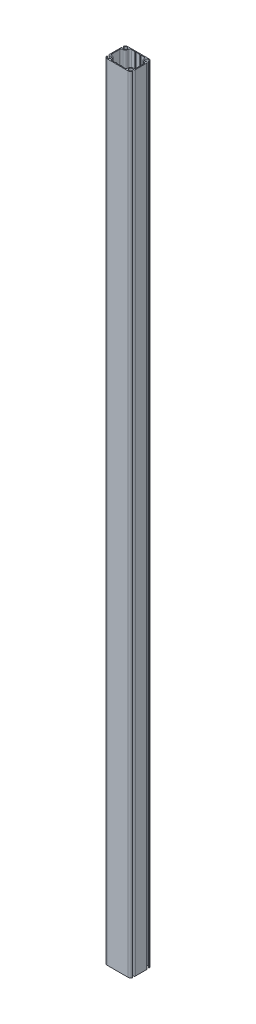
ISO-10303-21;
HEADER;
FILE_DESCRIPTION(('STEP AP214'),'2;1');
FILE_NAME('part.step','',(''),(''),'','','');
FILE_SCHEMA(('AUTOMOTIVE_DESIGN { 1 0 10303 214 1 1 1 1 }'));
ENDSEC;
DATA;
#1=APPLICATION_CONTEXT('core data for automotive mechanical design processes');
#2=APPLICATION_PROTOCOL_DEFINITION('international standard','automotive_design',2000,#1);
#3=PRODUCT_CONTEXT('',#1,'mechanical');
#4=PRODUCT('Part','Part','',(#3));
#5=PRODUCT_RELATED_PRODUCT_CATEGORY('part','',(#4));
#6=PRODUCT_DEFINITION_FORMATION('','',#4);
#7=PRODUCT_DEFINITION_CONTEXT('part definition',#1,'design');
#8=PRODUCT_DEFINITION('design','',#6,#7);
#9=PRODUCT_DEFINITION_SHAPE('','',#8);
#10=(LENGTH_UNIT() NAMED_UNIT(*) SI_UNIT(.MILLI.,.METRE.));
#11=(NAMED_UNIT(*) PLANE_ANGLE_UNIT() SI_UNIT($,.RADIAN.));
#12=(NAMED_UNIT(*) SI_UNIT($,.STERADIAN.) SOLID_ANGLE_UNIT());
#13=UNCERTAINTY_MEASURE_WITH_UNIT(LENGTH_MEASURE(1.E-05),#10,'distance_accuracy_value','');
#14=(GEOMETRIC_REPRESENTATION_CONTEXT(3) GLOBAL_UNCERTAINTY_ASSIGNED_CONTEXT((#13)) GLOBAL_UNIT_ASSIGNED_CONTEXT((#10,
#11,#12)) REPRESENTATION_CONTEXT('',''));
#15=CARTESIAN_POINT('',(0.,0.,0.));
#16=DIRECTION('',(0.,0.,1.));
#17=DIRECTION('',(1.,0.,0.));
#18=AXIS2_PLACEMENT_3D('',#15,#16,#17);
#19=CARTESIAN_POINT('',(48.2831217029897,3000.,-32.3501396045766));
#20=DIRECTION('',(0.,1.,0.));
#21=DIRECTION('',(0.,0.,1.));
#22=AXIS2_PLACEMENT_3D('',#19,#20,#21);
#23=PLANE('',#22);
#24=CARTESIAN_POINT('',(48.2831217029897,3000.,-32.3501396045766));
#25=DIRECTION('',(0.,1.,0.));
#26=DIRECTION('',(0.,0.,1.));
#27=AXIS2_PLACEMENT_3D('',#24,#25,#26);
#28=CIRCLE('',#27,1.50000000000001);
#29=CARTESIAN_POINT('',(46.823786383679,3000.,-32.0032384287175));
#30=VERTEX_POINT('',#29);
#31=CARTESIAN_POINT('',(49.7424570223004,3000.,-32.6970407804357));
#32=VERTEX_POINT('',#31);
#33=EDGE_CURVE('E598',#30,#32,#28,.T.);
#34=ORIENTED_EDGE('',*,*,#33,.T.);
#35=CARTESIAN_POINT('',(40.4999999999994,3000.,-30.4999999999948));
#36=DIRECTION('',(0.,1.,0.));
#37=DIRECTION('',(0.,0.,1.));
#38=AXIS2_PLACEMENT_3D('',#35,#36,#37);
#39=CIRCLE('',#38,9.5);
#40=CARTESIAN_POINT('',(40.4999999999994,3000.,-39.9999999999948));
#41=VERTEX_POINT('',#40);
#42=EDGE_CURVE('E601',#32,#41,#39,.T.);
#43=ORIENTED_EDGE('',*,*,#42,.T.);
#44=DIRECTION('',(-1.,0.,0.));
#45=VECTOR('',#44,1.);
#46=CARTESIAN_POINT('',(40.4999999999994,3000.,-39.9999999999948));
#47=LINE('',#46,#45);
#48=CARTESIAN_POINT('',(-40.4999999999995,3000.,-39.9999999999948));
#49=VERTEX_POINT('',#48);
#50=EDGE_CURVE('E604',#41,#49,#47,.T.);
#51=ORIENTED_EDGE('',*,*,#50,.T.);
#52=CARTESIAN_POINT('',(-40.4999999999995,3000.,-30.4999999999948));
#53=DIRECTION('',(0.,1.,0.));
#54=DIRECTION('',(0.,0.,-1.));
#55=AXIS2_PLACEMENT_3D('',#52,#53,#54);
#56=CIRCLE('',#55,9.5);
#57=CARTESIAN_POINT('',(-49.7424570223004,3000.,-32.6970407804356));
#58=VERTEX_POINT('',#57);
#59=EDGE_CURVE('E606',#49,#58,#56,.T.);
#60=ORIENTED_EDGE('',*,*,#59,.T.);
#61=CARTESIAN_POINT('',(-48.2831217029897,3000.,-32.3501396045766));
#62=DIRECTION('',(0.,1.,0.));
#63=DIRECTION('',(0.,0.,-1.));
#64=AXIS2_PLACEMENT_3D('',#61,#62,#63);
#65=CIRCLE('',#64,1.50000000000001);
#66=CARTESIAN_POINT('',(-46.8237863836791,3000.,-32.0032384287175));
#67=VERTEX_POINT('',#66);
#68=EDGE_CURVE('E608',#58,#67,#65,.T.);
#69=ORIENTED_EDGE('',*,*,#68,.T.);
#70=CARTESIAN_POINT('',(-40.4999999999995,3000.,-30.4999999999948));
#71=DIRECTION('',(0.,-1.,0.));
#72=DIRECTION('',(0.,0.,-1.));
#73=AXIS2_PLACEMENT_3D('',#70,#71,#72);
#74=CIRCLE('',#73,6.49999999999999);
#75=CARTESIAN_POINT('',(-43.9047619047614,3000.,-24.9630697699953));
#76=VERTEX_POINT('',#75);
#77=EDGE_CURVE('E610',#67,#76,#74,.T.);
#78=ORIENTED_EDGE('',*,*,#77,.T.);
#79=CARTESIAN_POINT('',(-45.9999999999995,3000.,-21.5557280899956));
#80=DIRECTION('',(0.,1.,0.));
#81=DIRECTION('',(0.,0.,-1.));
#82=AXIS2_PLACEMENT_3D('',#79,#80,#81);
#83=CIRCLE('',#82,4.);
#84=CARTESIAN_POINT('',(-49.9999999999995,3000.,-21.5557280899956));
#85=VERTEX_POINT('',#84);
#86=EDGE_CURVE('E612',#76,#85,#83,.T.);
#87=ORIENTED_EDGE('',*,*,#86,.T.);
#88=DIRECTION('',(0.,0.,1.));
#89=VECTOR('',#88,1.);
#90=CARTESIAN_POINT('',(-49.9999999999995,3000.,-21.5557280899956));
#91=LINE('',#90,#89);
#92=CARTESIAN_POINT('',(-49.9999999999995,3000.,21.5557280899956));
#93=VERTEX_POINT('',#92);
#94=EDGE_CURVE('E614',#85,#93,#91,.T.);
#95=ORIENTED_EDGE('',*,*,#94,.T.);
#96=CARTESIAN_POINT('',(-45.9999999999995,3000.,21.5557280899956));
#97=DIRECTION('',(0.,1.,0.));
#98=DIRECTION('',(0.,0.,1.));
#99=AXIS2_PLACEMENT_3D('',#96,#97,#98);
#100=CIRCLE('',#99,4.);
#101=CARTESIAN_POINT('',(-43.9047619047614,3000.,24.9630697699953));
#102=VERTEX_POINT('',#101);
#103=EDGE_CURVE('E616',#93,#102,#100,.T.);
#104=ORIENTED_EDGE('',*,*,#103,.T.);
#105=CARTESIAN_POINT('',(-40.4999999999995,3000.,30.4999999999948));
#106=DIRECTION('',(0.,-1.,0.));
#107=DIRECTION('',(0.,0.,1.));
#108=AXIS2_PLACEMENT_3D('',#105,#106,#107);
#109=CIRCLE('',#108,6.5);
#110=CARTESIAN_POINT('',(-46.823786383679,3000.,32.0032384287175));
#111=VERTEX_POINT('',#110);
#112=EDGE_CURVE('E618',#102,#111,#109,.T.);
#113=ORIENTED_EDGE('',*,*,#112,.T.);
#114=CARTESIAN_POINT('',(-48.2831217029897,3000.,32.3501396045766));
#115=DIRECTION('',(0.,1.,0.));
#116=DIRECTION('',(0.,0.,1.));
#117=AXIS2_PLACEMENT_3D('',#114,#115,#116);
#118=CIRCLE('',#117,1.50000000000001);
#119=CARTESIAN_POINT('',(-49.7424570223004,3000.,32.6970407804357));
#120=VERTEX_POINT('',#119);
#121=EDGE_CURVE('E620',#111,#120,#118,.T.);
#122=ORIENTED_EDGE('',*,*,#121,.T.);
#123=CARTESIAN_POINT('',(-40.4999999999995,3000.,30.4999999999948));
#124=DIRECTION('',(0.,1.,0.));
#125=DIRECTION('',(0.,0.,1.));
#126=AXIS2_PLACEMENT_3D('',#123,#124,#125);
#127=CIRCLE('',#126,9.5);
#128=CARTESIAN_POINT('',(-40.4999999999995,3000.,39.9999999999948));
#129=VERTEX_POINT('',#128);
#130=EDGE_CURVE('E622',#120,#129,#127,.T.);
#131=ORIENTED_EDGE('',*,*,#130,.T.);
#132=DIRECTION('',(1.,0.,0.));
#133=VECTOR('',#132,1.);
#134=CARTESIAN_POINT('',(40.4999999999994,3000.,39.9999999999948));
#135=LINE('',#134,#133);
#136=CARTESIAN_POINT('',(40.4999999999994,3000.,39.9999999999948));
#137=VERTEX_POINT('',#136);
#138=EDGE_CURVE('E624',#129,#137,#135,.T.);
#139=ORIENTED_EDGE('',*,*,#138,.T.);
#140=CARTESIAN_POINT('',(40.4999999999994,3000.,30.4999999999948));
#141=DIRECTION('',(0.,1.,0.));
#142=DIRECTION('',(0.,0.,-1.));
#143=AXIS2_PLACEMENT_3D('',#140,#141,#142);
#144=CIRCLE('',#143,9.5);
#145=CARTESIAN_POINT('',(49.7424570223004,3000.,32.6970407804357));
#146=VERTEX_POINT('',#145);
#147=EDGE_CURVE('E626',#137,#146,#144,.T.);
#148=ORIENTED_EDGE('',*,*,#147,.T.);
#149=CARTESIAN_POINT('',(48.2831217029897,3000.,32.3501396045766));
#150=DIRECTION('',(0.,1.,0.));
#151=DIRECTION('',(0.,0.,-1.));
#152=AXIS2_PLACEMENT_3D('',#149,#150,#151);
#153=CIRCLE('',#152,1.50000000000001);
#154=CARTESIAN_POINT('',(46.823786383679,3000.,32.0032384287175));
#155=VERTEX_POINT('',#154);
#156=EDGE_CURVE('E628',#146,#155,#153,.T.);
#157=ORIENTED_EDGE('',*,*,#156,.T.);
#158=CARTESIAN_POINT('',(40.4999999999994,3000.,30.4999999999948));
#159=DIRECTION('',(0.,-1.,0.));
#160=DIRECTION('',(0.,0.,-1.));
#161=AXIS2_PLACEMENT_3D('',#158,#159,#160);
#162=CIRCLE('',#161,6.5);
#163=CARTESIAN_POINT('',(43.9047619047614,3000.,24.9630697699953));
#164=VERTEX_POINT('',#163);
#165=EDGE_CURVE('E630',#155,#164,#162,.T.);
#166=ORIENTED_EDGE('',*,*,#165,.T.);
#167=CARTESIAN_POINT('',(45.9999999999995,3000.,21.5557280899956));
#168=DIRECTION('',(0.,1.,0.));
#169=DIRECTION('',(0.,0.,-1.));
#170=AXIS2_PLACEMENT_3D('',#167,#168,#169);
#171=CIRCLE('',#170,4.);
#172=CARTESIAN_POINT('',(49.9999999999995,3000.,21.5557280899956));
#173=VERTEX_POINT('',#172);
#174=EDGE_CURVE('E632',#164,#173,#171,.T.);
#175=ORIENTED_EDGE('',*,*,#174,.T.);
#176=DIRECTION('',(0.,0.,-1.));
#177=VECTOR('',#176,1.);
#178=CARTESIAN_POINT('',(49.9999999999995,3000.,-21.5557280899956));
#179=LINE('',#178,#177);
#180=CARTESIAN_POINT('',(49.9999999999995,3000.,-21.5557280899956));
#181=VERTEX_POINT('',#180);
#182=EDGE_CURVE('E634',#173,#181,#179,.T.);
#183=ORIENTED_EDGE('',*,*,#182,.T.);
#184=CARTESIAN_POINT('',(45.9999999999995,3000.,-21.5557280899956));
#185=DIRECTION('',(0.,1.,0.));
#186=DIRECTION('',(0.,0.,1.));
#187=AXIS2_PLACEMENT_3D('',#184,#185,#186);
#188=CIRCLE('',#187,4.);
#189=CARTESIAN_POINT('',(43.9047619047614,3000.,-24.9630697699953));
#190=VERTEX_POINT('',#189);
#191=EDGE_CURVE('E636',#181,#190,#188,.T.);
#192=ORIENTED_EDGE('',*,*,#191,.T.);
#193=CARTESIAN_POINT('',(40.4999999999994,3000.,-30.4999999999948));
#194=DIRECTION('',(0.,-1.,0.));
#195=DIRECTION('',(0.,0.,1.));
#196=AXIS2_PLACEMENT_3D('',#193,#194,#195);
#197=CIRCLE('',#196,6.5);
#198=EDGE_CURVE('E638',#190,#30,#197,.T.);
#199=ORIENTED_EDGE('',*,*,#198,.T.);
#200=EDGE_LOOP('',(#34,#43,#51,#60,#69,#78,#87,#95,#104,#113,#122,#131,#139,#148,#157,#166,#175,
#183,#192,#199));
#201=FACE_BOUND('',#200,.T.);
#202=DIRECTION('',(-1.,0.,1.07552855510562E-13));
#203=VECTOR('',#202,1.);
#204=CARTESIAN_POINT('',(-12.5,3000.,-36.9999999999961));
#205=LINE('',#204,#203);
#206=CARTESIAN_POINT('',(-12.5,3000.,-36.9999999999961));
#207=VERTEX_POINT('',#206);
#208=CARTESIAN_POINT('',(-24.4999999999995,3000.,-36.9999999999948));
#209=VERTEX_POINT('',#208);
#210=EDGE_CURVE('E373',#207,#209,#205,.T.);
#211=ORIENTED_EDGE('',*,*,#210,.F.);
#212=DIRECTION('',(-0.707106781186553,0.,-0.707106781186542));
#213=VECTOR('',#212,1.);
#214=CARTESIAN_POINT('',(-11.,3000.,-35.4999999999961));
#215=LINE('',#214,#213);
#216=CARTESIAN_POINT('',(-11.,3000.,-35.4999999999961));
#217=VERTEX_POINT('',#216);
#218=EDGE_CURVE('E365',#217,#207,#215,.T.);
#219=ORIENTED_EDGE('',*,*,#218,.F.);
#220=DIRECTION('',(-1.,0.,0.));
#221=VECTOR('',#220,1.);
#222=CARTESIAN_POINT('',(-11.,3000.,-35.4999999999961));
#223=LINE('',#222,#221);
#224=CARTESIAN_POINT('',(-8.,3000.,-35.4999999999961));
#225=VERTEX_POINT('',#224);
#226=EDGE_CURVE('E446',#225,#217,#223,.T.);
#227=ORIENTED_EDGE('',*,*,#226,.F.);
#228=DIRECTION('',(-0.707106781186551,0.,0.707106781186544));
#229=VECTOR('',#228,1.);
#230=CARTESIAN_POINT('',(-8.,3000.,-35.4999999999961));
#231=LINE('',#230,#229);
#232=CARTESIAN_POINT('',(-6.50000000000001,3000.,-36.9999999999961));
#233=VERTEX_POINT('',#232);
#234=EDGE_CURVE('E444',#233,#225,#231,.T.);
#235=ORIENTED_EDGE('',*,*,#234,.F.);
#236=DIRECTION('',(-1.,0.,0.));
#237=VECTOR('',#236,1.);
#238=CARTESIAN_POINT('',(6.50000000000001,3000.,-36.9999999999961));
#239=LINE('',#238,#237);
#240=CARTESIAN_POINT('',(6.50000000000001,3000.,-36.9999999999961));
#241=VERTEX_POINT('',#240);
#242=EDGE_CURVE('E442',#241,#233,#239,.T.);
#243=ORIENTED_EDGE('',*,*,#242,.F.);
#244=DIRECTION('',(-0.707106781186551,0.,-0.707106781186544));
#245=VECTOR('',#244,1.);
#246=CARTESIAN_POINT('',(8.,3000.,-35.4999999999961));
#247=LINE('',#246,#245);
#248=CARTESIAN_POINT('',(8.,3000.,-35.4999999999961));
#249=VERTEX_POINT('',#248);
#250=EDGE_CURVE('E440',#249,#241,#247,.T.);
#251=ORIENTED_EDGE('',*,*,#250,.F.);
#252=DIRECTION('',(-1.,0.,0.));
#253=VECTOR('',#252,1.);
#254=CARTESIAN_POINT('',(11.,3000.,-35.4999999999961));
#255=LINE('',#254,#253);
#256=CARTESIAN_POINT('',(11.,3000.,-35.4999999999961));
#257=VERTEX_POINT('',#256);
#258=EDGE_CURVE('E438',#257,#249,#255,.T.);
#259=ORIENTED_EDGE('',*,*,#258,.F.);
#260=DIRECTION('',(-0.707106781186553,0.,0.707106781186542));
#261=VECTOR('',#260,1.);
#262=CARTESIAN_POINT('',(11.,3000.,-35.4999999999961));
#263=LINE('',#262,#261);
#264=CARTESIAN_POINT('',(12.5,3000.,-36.9999999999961));
#265=VERTEX_POINT('',#264);
#266=EDGE_CURVE('E436',#265,#257,#263,.T.);
#267=ORIENTED_EDGE('',*,*,#266,.F.);
#268=DIRECTION('',(-1.,0.,0.));
#269=VECTOR('',#268,1.);
#270=CARTESIAN_POINT('',(24.4999999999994,3000.,-36.9999999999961));
#271=LINE('',#270,#269);
#272=CARTESIAN_POINT('',(24.4999999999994,3000.,-36.9999999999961));
#273=VERTEX_POINT('',#272);
#274=EDGE_CURVE('E434',#273,#265,#271,.T.);
#275=ORIENTED_EDGE('',*,*,#274,.F.);
#276=CARTESIAN_POINT('',(24.4999999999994,3000.,-30.4999999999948));
#277=DIRECTION('',(0.,1.,0.));
#278=DIRECTION('',(0.,0.,1.));
#279=AXIS2_PLACEMENT_3D('',#276,#277,#278);
#280=CIRCLE('',#279,6.50000000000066);
#281=CARTESIAN_POINT('',(31.0000000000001,3000.,-30.4999999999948));
#282=VERTEX_POINT('',#281);
#283=EDGE_CURVE('E432',#282,#273,#280,.T.);
#284=ORIENTED_EDGE('',*,*,#283,.F.);
#285=CARTESIAN_POINT('',(40.4999999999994,3000.,-30.4999999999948));
#286=DIRECTION('',(0.,-1.,0.));
#287=DIRECTION('',(0.,0.,1.));
#288=AXIS2_PLACEMENT_3D('',#285,#286,#287);
#289=CIRCLE('',#288,9.5);
#290=CARTESIAN_POINT('',(40.4999999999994,3000.,-20.9999999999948));
#291=VERTEX_POINT('',#290);
#292=EDGE_CURVE('E430',#291,#282,#289,.T.);
#293=ORIENTED_EDGE('',*,*,#292,.F.);
#294=CARTESIAN_POINT('',(40.4999999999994,3000.,-14.4999999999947));
#295=DIRECTION('',(0.,1.,0.));
#296=DIRECTION('',(0.,0.,1.));
#297=AXIS2_PLACEMENT_3D('',#294,#295,#296);
#298=CIRCLE('',#297,6.50000000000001);
#299=CARTESIAN_POINT('',(46.9999999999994,3000.,-14.4999999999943));
#300=VERTEX_POINT('',#299);
#301=EDGE_CURVE('E428',#300,#291,#298,.T.);
#302=ORIENTED_EDGE('',*,*,#301,.F.);
#303=DIRECTION('',(0.,0.,-1.));
#304=VECTOR('',#303,1.);
#305=CARTESIAN_POINT('',(46.9999999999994,3000.,-14.4999999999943));
#306=LINE('',#305,#304);
#307=CARTESIAN_POINT('',(46.9999999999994,3000.,14.4999999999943));
#308=VERTEX_POINT('',#307);
#309=EDGE_CURVE('E426',#308,#300,#306,.T.);
#310=ORIENTED_EDGE('',*,*,#309,.F.);
#311=CARTESIAN_POINT('',(40.4999999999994,3000.,14.4999999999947));
#312=DIRECTION('',(0.,1.,0.));
#313=DIRECTION('',(0.,0.,-1.));
#314=AXIS2_PLACEMENT_3D('',#311,#312,#313);
#315=CIRCLE('',#314,6.50000000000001);
#316=CARTESIAN_POINT('',(40.4999999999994,3000.,20.9999999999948));
#317=VERTEX_POINT('',#316);
#318=EDGE_CURVE('E424',#317,#308,#315,.T.);
#319=ORIENTED_EDGE('',*,*,#318,.F.);
#320=CARTESIAN_POINT('',(40.4999999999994,3000.,30.4999999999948));
#321=DIRECTION('',(0.,-1.,0.));
#322=DIRECTION('',(0.,0.,-1.));
#323=AXIS2_PLACEMENT_3D('',#320,#321,#322);
#324=CIRCLE('',#323,9.5);
#325=CARTESIAN_POINT('',(30.9999999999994,3000.,30.4999999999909));
#326=VERTEX_POINT('',#325);
#327=EDGE_CURVE('E422',#326,#317,#324,.T.);
#328=ORIENTED_EDGE('',*,*,#327,.F.);
#329=CARTESIAN_POINT('',(24.4999999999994,3000.,30.4999999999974));
#330=DIRECTION('',(0.,1.,0.));
#331=DIRECTION('',(0.,0.,-1.));
#332=AXIS2_PLACEMENT_3D('',#329,#330,#331);
#333=CIRCLE('',#332,6.50000000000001);
#334=CARTESIAN_POINT('',(24.5,3000.,36.9999999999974));
#335=VERTEX_POINT('',#334);
#336=EDGE_CURVE('E420',#335,#326,#333,.T.);
#337=ORIENTED_EDGE('',*,*,#336,.F.);
#338=DIRECTION('',(1.,0.,1.0870933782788E-13));
#339=VECTOR('',#338,1.);
#340=CARTESIAN_POINT('',(24.5,3000.,36.9999999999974));
#341=LINE('',#340,#339);
#342=CARTESIAN_POINT('',(12.5,3000.,36.9999999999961));
#343=VERTEX_POINT('',#342);
#344=EDGE_CURVE('E418',#343,#335,#341,.T.);
#345=ORIENTED_EDGE('',*,*,#344,.F.);
#346=DIRECTION('',(0.707106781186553,0.,0.707106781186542));
#347=VECTOR('',#346,1.);
#348=CARTESIAN_POINT('',(11.,3000.,35.4999999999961));
#349=LINE('',#348,#347);
#350=CARTESIAN_POINT('',(11.,3000.,35.4999999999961));
#351=VERTEX_POINT('',#350);
#352=EDGE_CURVE('E416',#351,#343,#349,.T.);
#353=ORIENTED_EDGE('',*,*,#352,.F.);
#354=DIRECTION('',(1.,0.,0.));
#355=VECTOR('',#354,1.);
#356=CARTESIAN_POINT('',(11.,3000.,35.4999999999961));
#357=LINE('',#356,#355);
#358=CARTESIAN_POINT('',(8.,3000.,35.4999999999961));
#359=VERTEX_POINT('',#358);
#360=EDGE_CURVE('E414',#359,#351,#357,.T.);
#361=ORIENTED_EDGE('',*,*,#360,.F.);
#362=DIRECTION('',(0.707106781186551,0.,-0.707106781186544));
#363=VECTOR('',#362,1.);
#364=CARTESIAN_POINT('',(8.,3000.,35.4999999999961));
#365=LINE('',#364,#363);
#366=CARTESIAN_POINT('',(6.50000000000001,3000.,36.9999999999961));
#367=VERTEX_POINT('',#366);
#368=EDGE_CURVE('E412',#367,#359,#365,.T.);
#369=ORIENTED_EDGE('',*,*,#368,.F.);
#370=DIRECTION('',(1.,0.,0.));
#371=VECTOR('',#370,1.);
#372=CARTESIAN_POINT('',(6.50000000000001,3000.,36.9999999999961));
#373=LINE('',#372,#371);
#374=CARTESIAN_POINT('',(-6.50000000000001,3000.,36.9999999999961));
#375=VERTEX_POINT('',#374);
#376=EDGE_CURVE('E410',#375,#367,#373,.T.);
#377=ORIENTED_EDGE('',*,*,#376,.F.);
#378=DIRECTION('',(0.707106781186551,0.,0.707106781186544));
#379=VECTOR('',#378,1.);
#380=CARTESIAN_POINT('',(-8.,3000.,35.4999999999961));
#381=LINE('',#380,#379);
#382=CARTESIAN_POINT('',(-8.,3000.,35.4999999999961));
#383=VERTEX_POINT('',#382);
#384=EDGE_CURVE('E408',#383,#375,#381,.T.);
#385=ORIENTED_EDGE('',*,*,#384,.F.);
#386=DIRECTION('',(1.,0.,0.));
#387=VECTOR('',#386,1.);
#388=CARTESIAN_POINT('',(-11.,3000.,35.4999999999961));
#389=LINE('',#388,#387);
#390=CARTESIAN_POINT('',(-11.,3000.,35.4999999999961));
#391=VERTEX_POINT('',#390);
#392=EDGE_CURVE('E406',#391,#383,#389,.T.);
#393=ORIENTED_EDGE('',*,*,#392,.F.);
#394=DIRECTION('',(0.707106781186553,0.,-0.707106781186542));
#395=VECTOR('',#394,1.);
#396=CARTESIAN_POINT('',(-11.,3000.,35.4999999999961));
#397=LINE('',#396,#395);
#398=CARTESIAN_POINT('',(-12.5,3000.,36.9999999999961));
#399=VERTEX_POINT('',#398);
#400=EDGE_CURVE('E404',#399,#391,#397,.T.);
#401=ORIENTED_EDGE('',*,*,#400,.F.);
#402=DIRECTION('',(1.,0.,-1.0870933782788E-13));
#403=VECTOR('',#402,1.);
#404=CARTESIAN_POINT('',(-12.5,3000.,36.9999999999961));
#405=LINE('',#404,#403);
#406=CARTESIAN_POINT('',(-24.5,3000.,36.9999999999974));
#407=VERTEX_POINT('',#406);
#408=EDGE_CURVE('E402',#407,#399,#405,.T.);
#409=ORIENTED_EDGE('',*,*,#408,.F.);
#410=CARTESIAN_POINT('',(-24.4999999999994,3000.,30.4999999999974));
#411=DIRECTION('',(0.,1.,0.));
#412=DIRECTION('',(0.,0.,1.));
#413=AXIS2_PLACEMENT_3D('',#410,#411,#412);
#414=CIRCLE('',#413,6.50000000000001);
#415=CARTESIAN_POINT('',(-30.9999999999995,3000.,30.4999999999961));
#416=VERTEX_POINT('',#415);
#417=EDGE_CURVE('E400',#416,#407,#414,.T.);
#418=ORIENTED_EDGE('',*,*,#417,.F.);
#419=CARTESIAN_POINT('',(-40.4999999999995,3000.,30.4999999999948));
#420=DIRECTION('',(0.,-1.,0.));
#421=DIRECTION('',(0.,0.,1.));
#422=AXIS2_PLACEMENT_3D('',#419,#420,#421);
#423=CIRCLE('',#422,9.5);
#424=CARTESIAN_POINT('',(-40.4999999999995,3000.,20.9999999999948));
#425=VERTEX_POINT('',#424);
#426=EDGE_CURVE('E398',#425,#416,#423,.T.);
#427=ORIENTED_EDGE('',*,*,#426,.F.);
#428=CARTESIAN_POINT('',(-40.4999999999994,3000.,14.4999999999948));
#429=DIRECTION('',(0.,1.,0.));
#430=DIRECTION('',(0.,0.,1.));
#431=AXIS2_PLACEMENT_3D('',#428,#429,#430);
#432=CIRCLE('',#431,6.50000000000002);
#433=CARTESIAN_POINT('',(-46.9999999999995,3000.,14.4999999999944));
#434=VERTEX_POINT('',#433);
#435=EDGE_CURVE('E396',#434,#425,#432,.T.);
#436=ORIENTED_EDGE('',*,*,#435,.F.);
#437=DIRECTION('',(0.,0.,1.));
#438=VECTOR('',#437,1.);
#439=CARTESIAN_POINT('',(-46.9999999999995,3000.,-14.4999999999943));
#440=LINE('',#439,#438);
#441=CARTESIAN_POINT('',(-46.9999999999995,3000.,-14.4999999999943));
#442=VERTEX_POINT('',#441);
#443=EDGE_CURVE('E394',#442,#434,#440,.T.);
#444=ORIENTED_EDGE('',*,*,#443,.F.);
#445=CARTESIAN_POINT('',(-40.4999999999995,3000.,-14.4999999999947));
#446=DIRECTION('',(0.,1.,0.));
#447=DIRECTION('',(0.,0.,-1.));
#448=AXIS2_PLACEMENT_3D('',#445,#446,#447);
#449=CIRCLE('',#448,6.50000000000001);
#450=CARTESIAN_POINT('',(-40.4999999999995,3000.,-20.9999999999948));
#451=VERTEX_POINT('',#450);
#452=EDGE_CURVE('E392',#451,#442,#449,.T.);
#453=ORIENTED_EDGE('',*,*,#452,.F.);
#454=CARTESIAN_POINT('',(-40.4999999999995,3000.,-30.4999999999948));
#455=DIRECTION('',(0.,-1.,0.));
#456=DIRECTION('',(0.,0.,-1.));
#457=AXIS2_PLACEMENT_3D('',#454,#455,#456);
#458=CIRCLE('',#457,9.50000000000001);
#459=CARTESIAN_POINT('',(-30.9999999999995,3000.,-30.4999999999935));
#460=VERTEX_POINT('',#459);
#461=EDGE_CURVE('E388',#460,#451,#458,.T.);
#462=ORIENTED_EDGE('',*,*,#461,.F.);
#463=CARTESIAN_POINT('',(-24.4999999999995,3000.,-30.4999999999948));
#464=DIRECTION('',(0.,1.,0.));
#465=DIRECTION('',(0.,0.,-1.));
#466=AXIS2_PLACEMENT_3D('',#463,#464,#465);
#467=CIRCLE('',#466,6.50000000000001);
#468=EDGE_CURVE('E386',#209,#460,#467,.T.);
#469=ORIENTED_EDGE('',*,*,#468,.F.);
#470=EDGE_LOOP('',(#211,#219,#227,#235,#243,#251,#259,#267,#275,#284,#293,#302,#310,#319,#328,
#337,#345,#353,#361,#369,#377,#385,#393,#401,#409,#418,#427,#436,#444,#453,#462,#469));
#471=FACE_BOUND('',#470,.T.);
#472=ADVANCED_FACE('F36',(#201,#471),#23,.T.);
#473=CARTESIAN_POINT('',(48.2831217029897,0.,-32.3501396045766));
#474=DIRECTION('',(0.,1.,0.));
#475=DIRECTION('',(0.,0.,1.));
#476=AXIS2_PLACEMENT_3D('',#473,#474,#475);
#477=PLANE('',#476);
#478=CARTESIAN_POINT('',(48.2831217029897,0.,-32.3501396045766));
#479=DIRECTION('',(0.,1.,0.));
#480=DIRECTION('',(0.,0.,1.));
#481=AXIS2_PLACEMENT_3D('',#478,#479,#480);
#482=CIRCLE('',#481,1.50000000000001);
#483=CARTESIAN_POINT('',(46.823786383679,0.,-32.0032384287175));
#484=VERTEX_POINT('',#483);
#485=CARTESIAN_POINT('',(49.7424570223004,0.,-32.6970407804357));
#486=VERTEX_POINT('',#485);
#487=EDGE_CURVE('E381',#484,#486,#482,.T.);
#488=ORIENTED_EDGE('',*,*,#487,.F.);
#489=CARTESIAN_POINT('',(40.4999999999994,0.,-30.4999999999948));
#490=DIRECTION('',(0.,-1.,0.));
#491=DIRECTION('',(0.,0.,1.));
#492=AXIS2_PLACEMENT_3D('',#489,#490,#491);
#493=CIRCLE('',#492,6.5);
#494=CARTESIAN_POINT('',(43.9047619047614,0.,-24.9630697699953));
#495=VERTEX_POINT('',#494);
#496=EDGE_CURVE('E602',#495,#484,#493,.T.);
#497=ORIENTED_EDGE('',*,*,#496,.F.);
#498=CARTESIAN_POINT('',(45.9999999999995,0.,-21.5557280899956));
#499=DIRECTION('',(0.,1.,0.));
#500=DIRECTION('',(0.,0.,1.));
#501=AXIS2_PLACEMENT_3D('',#498,#499,#500);
#502=CIRCLE('',#501,4.);
#503=CARTESIAN_POINT('',(49.9999999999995,0.,-21.5557280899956));
#504=VERTEX_POINT('',#503);
#505=EDGE_CURVE('E677',#504,#495,#502,.T.);
#506=ORIENTED_EDGE('',*,*,#505,.F.);
#507=DIRECTION('',(0.,0.,-1.));
#508=VECTOR('',#507,1.);
#509=CARTESIAN_POINT('',(49.9999999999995,0.,-21.5557280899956));
#510=LINE('',#509,#508);
#511=CARTESIAN_POINT('',(49.9999999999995,0.,21.5557280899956));
#512=VERTEX_POINT('',#511);
#513=EDGE_CURVE('E675',#512,#504,#510,.T.);
#514=ORIENTED_EDGE('',*,*,#513,.F.);
#515=CARTESIAN_POINT('',(45.9999999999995,0.,21.5557280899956));
#516=DIRECTION('',(0.,1.,0.));
#517=DIRECTION('',(0.,0.,-1.));
#518=AXIS2_PLACEMENT_3D('',#515,#516,#517);
#519=CIRCLE('',#518,4.);
#520=CARTESIAN_POINT('',(43.9047619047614,0.,24.9630697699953));
#521=VERTEX_POINT('',#520);
#522=EDGE_CURVE('E673',#521,#512,#519,.T.);
#523=ORIENTED_EDGE('',*,*,#522,.F.);
#524=CARTESIAN_POINT('',(40.4999999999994,0.,30.4999999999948));
#525=DIRECTION('',(0.,-1.,0.));
#526=DIRECTION('',(0.,0.,-1.));
#527=AXIS2_PLACEMENT_3D('',#524,#525,#526);
#528=CIRCLE('',#527,6.5);
#529=CARTESIAN_POINT('',(46.823786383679,0.,32.0032384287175));
#530=VERTEX_POINT('',#529);
#531=EDGE_CURVE('E671',#530,#521,#528,.T.);
#532=ORIENTED_EDGE('',*,*,#531,.F.);
#533=CARTESIAN_POINT('',(48.2831217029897,0.,32.3501396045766));
#534=DIRECTION('',(0.,1.,0.));
#535=DIRECTION('',(0.,0.,-1.));
#536=AXIS2_PLACEMENT_3D('',#533,#534,#535);
#537=CIRCLE('',#536,1.50000000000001);
#538=CARTESIAN_POINT('',(49.7424570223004,0.,32.6970407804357));
#539=VERTEX_POINT('',#538);
#540=EDGE_CURVE('E669',#539,#530,#537,.T.);
#541=ORIENTED_EDGE('',*,*,#540,.F.);
#542=CARTESIAN_POINT('',(40.4999999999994,0.,30.4999999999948));
#543=DIRECTION('',(0.,1.,0.));
#544=DIRECTION('',(0.,0.,-1.));
#545=AXIS2_PLACEMENT_3D('',#542,#543,#544);
#546=CIRCLE('',#545,9.5);
#547=CARTESIAN_POINT('',(40.4999999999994,0.,39.9999999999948));
#548=VERTEX_POINT('',#547);
#549=EDGE_CURVE('E667',#548,#539,#546,.T.);
#550=ORIENTED_EDGE('',*,*,#549,.F.);
#551=DIRECTION('',(1.,0.,0.));
#552=VECTOR('',#551,1.);
#553=CARTESIAN_POINT('',(40.4999999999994,0.,39.9999999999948));
#554=LINE('',#553,#552);
#555=CARTESIAN_POINT('',(-40.4999999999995,0.,39.9999999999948));
#556=VERTEX_POINT('',#555);
#557=EDGE_CURVE('E665',#556,#548,#554,.T.);
#558=ORIENTED_EDGE('',*,*,#557,.F.);
#559=CARTESIAN_POINT('',(-40.4999999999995,0.,30.4999999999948));
#560=DIRECTION('',(0.,1.,0.));
#561=DIRECTION('',(0.,0.,1.));
#562=AXIS2_PLACEMENT_3D('',#559,#560,#561);
#563=CIRCLE('',#562,9.5);
#564=CARTESIAN_POINT('',(-49.7424570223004,0.,32.6970407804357));
#565=VERTEX_POINT('',#564);
#566=EDGE_CURVE('E663',#565,#556,#563,.T.);
#567=ORIENTED_EDGE('',*,*,#566,.F.);
#568=CARTESIAN_POINT('',(-48.2831217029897,0.,32.3501396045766));
#569=DIRECTION('',(0.,1.,0.));
#570=DIRECTION('',(0.,0.,1.));
#571=AXIS2_PLACEMENT_3D('',#568,#569,#570);
#572=CIRCLE('',#571,1.50000000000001);
#573=CARTESIAN_POINT('',(-46.823786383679,0.,32.0032384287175));
#574=VERTEX_POINT('',#573);
#575=EDGE_CURVE('E661',#574,#565,#572,.T.);
#576=ORIENTED_EDGE('',*,*,#575,.F.);
#577=CARTESIAN_POINT('',(-40.4999999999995,0.,30.4999999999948));
#578=DIRECTION('',(0.,-1.,0.));
#579=DIRECTION('',(0.,0.,1.));
#580=AXIS2_PLACEMENT_3D('',#577,#578,#579);
#581=CIRCLE('',#580,6.5);
#582=CARTESIAN_POINT('',(-43.9047619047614,0.,24.9630697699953));
#583=VERTEX_POINT('',#582);
#584=EDGE_CURVE('E659',#583,#574,#581,.T.);
#585=ORIENTED_EDGE('',*,*,#584,.F.);
#586=CARTESIAN_POINT('',(-45.9999999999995,0.,21.5557280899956));
#587=DIRECTION('',(0.,1.,0.));
#588=DIRECTION('',(0.,0.,1.));
#589=AXIS2_PLACEMENT_3D('',#586,#587,#588);
#590=CIRCLE('',#589,4.);
#591=CARTESIAN_POINT('',(-49.9999999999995,0.,21.5557280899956));
#592=VERTEX_POINT('',#591);
#593=EDGE_CURVE('E657',#592,#583,#590,.T.);
#594=ORIENTED_EDGE('',*,*,#593,.F.);
#595=DIRECTION('',(0.,0.,1.));
#596=VECTOR('',#595,1.);
#597=CARTESIAN_POINT('',(-49.9999999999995,0.,-21.5557280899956));
#598=LINE('',#597,#596);
#599=CARTESIAN_POINT('',(-49.9999999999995,0.,-21.5557280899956));
#600=VERTEX_POINT('',#599);
#601=EDGE_CURVE('E655',#600,#592,#598,.T.);
#602=ORIENTED_EDGE('',*,*,#601,.F.);
#603=CARTESIAN_POINT('',(-45.9999999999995,0.,-21.5557280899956));
#604=DIRECTION('',(0.,1.,0.));
#605=DIRECTION('',(0.,0.,-1.));
#606=AXIS2_PLACEMENT_3D('',#603,#604,#605);
#607=CIRCLE('',#606,4.);
#608=CARTESIAN_POINT('',(-43.9047619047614,0.,-24.9630697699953));
#609=VERTEX_POINT('',#608);
#610=EDGE_CURVE('E653',#609,#600,#607,.T.);
#611=ORIENTED_EDGE('',*,*,#610,.F.);
#612=CARTESIAN_POINT('',(-40.4999999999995,0.,-30.4999999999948));
#613=DIRECTION('',(0.,-1.,0.));
#614=DIRECTION('',(0.,0.,-1.));
#615=AXIS2_PLACEMENT_3D('',#612,#613,#614);
#616=CIRCLE('',#615,6.49999999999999);
#617=CARTESIAN_POINT('',(-46.8237863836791,0.,-32.0032384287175));
#618=VERTEX_POINT('',#617);
#619=EDGE_CURVE('E651',#618,#609,#616,.T.);
#620=ORIENTED_EDGE('',*,*,#619,.F.);
#621=CARTESIAN_POINT('',(-48.2831217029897,0.,-32.3501396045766));
#622=DIRECTION('',(0.,1.,0.));
#623=DIRECTION('',(0.,0.,-1.));
#624=AXIS2_PLACEMENT_3D('',#621,#622,#623);
#625=CIRCLE('',#624,1.50000000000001);
#626=CARTESIAN_POINT('',(-49.7424570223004,0.,-32.6970407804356));
#627=VERTEX_POINT('',#626);
#628=EDGE_CURVE('E649',#627,#618,#625,.T.);
#629=ORIENTED_EDGE('',*,*,#628,.F.);
#630=CARTESIAN_POINT('',(-40.4999999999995,0.,-30.4999999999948));
#631=DIRECTION('',(0.,1.,0.));
#632=DIRECTION('',(0.,0.,-1.));
#633=AXIS2_PLACEMENT_3D('',#630,#631,#632);
#634=CIRCLE('',#633,9.5);
#635=CARTESIAN_POINT('',(-40.4999999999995,0.,-39.9999999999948));
#636=VERTEX_POINT('',#635);
#637=EDGE_CURVE('E647',#636,#627,#634,.T.);
#638=ORIENTED_EDGE('',*,*,#637,.F.);
#639=DIRECTION('',(-1.,0.,0.));
#640=VECTOR('',#639,1.);
#641=CARTESIAN_POINT('',(40.4999999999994,0.,-39.9999999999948));
#642=LINE('',#641,#640);
#643=CARTESIAN_POINT('',(40.4999999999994,0.,-39.9999999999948));
#644=VERTEX_POINT('',#643);
#645=EDGE_CURVE('E645',#644,#636,#642,.T.);
#646=ORIENTED_EDGE('',*,*,#645,.F.);
#647=CARTESIAN_POINT('',(40.4999999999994,0.,-30.4999999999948));
#648=DIRECTION('',(0.,1.,0.));
#649=DIRECTION('',(0.,0.,1.));
#650=AXIS2_PLACEMENT_3D('',#647,#648,#649);
#651=CIRCLE('',#650,9.5);
#652=EDGE_CURVE('E643',#486,#644,#651,.T.);
#653=ORIENTED_EDGE('',*,*,#652,.F.);
#654=EDGE_LOOP('',(#488,#497,#506,#514,#523,#532,#541,#550,#558,#567,#576,#585,#594,#602,#611,
#620,#629,#638,#646,#653));
#655=FACE_BOUND('',#654,.T.);
#656=DIRECTION('',(-0.707106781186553,0.,-0.707106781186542));
#657=VECTOR('',#656,1.);
#658=CARTESIAN_POINT('',(-11.,0.,-35.4999999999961));
#659=LINE('',#658,#657);
#660=CARTESIAN_POINT('',(-11.,0.,-35.4999999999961));
#661=VERTEX_POINT('',#660);
#662=CARTESIAN_POINT('',(-12.5,0.,-36.9999999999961));
#663=VERTEX_POINT('',#662);
#664=EDGE_CURVE('E59',#661,#663,#659,.T.);
#665=ORIENTED_EDGE('',*,*,#664,.T.);
#666=DIRECTION('',(-1.,0.,1.07552855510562E-13));
#667=VECTOR('',#666,1.);
#668=CARTESIAN_POINT('',(-12.5,0.,-36.9999999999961));
#669=LINE('',#668,#667);
#670=CARTESIAN_POINT('',(-24.4999999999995,0.,-36.9999999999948));
#671=VERTEX_POINT('',#670);
#672=EDGE_CURVE('E380',#663,#671,#669,.T.);
#673=ORIENTED_EDGE('',*,*,#672,.T.);
#674=CARTESIAN_POINT('',(-24.4999999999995,0.,-30.4999999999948));
#675=DIRECTION('',(0.,1.,0.));
#676=DIRECTION('',(0.,0.,-1.));
#677=AXIS2_PLACEMENT_3D('',#674,#675,#676);
#678=CIRCLE('',#677,6.50000000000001);
#679=CARTESIAN_POINT('',(-30.9999999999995,0.,-30.4999999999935));
#680=VERTEX_POINT('',#679);
#681=EDGE_CURVE('E450',#671,#680,#678,.T.);
#682=ORIENTED_EDGE('',*,*,#681,.T.);
#683=CARTESIAN_POINT('',(-40.4999999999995,0.,-30.4999999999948));
#684=DIRECTION('',(0.,-1.,0.));
#685=DIRECTION('',(0.,0.,-1.));
#686=AXIS2_PLACEMENT_3D('',#683,#684,#685);
#687=CIRCLE('',#686,9.50000000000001);
#688=CARTESIAN_POINT('',(-40.4999999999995,0.,-20.9999999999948));
#689=VERTEX_POINT('',#688);
#690=EDGE_CURVE('E453',#680,#689,#687,.T.);
#691=ORIENTED_EDGE('',*,*,#690,.T.);
#692=CARTESIAN_POINT('',(-40.4999999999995,0.,-14.4999999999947));
#693=DIRECTION('',(0.,1.,0.));
#694=DIRECTION('',(0.,0.,-1.));
#695=AXIS2_PLACEMENT_3D('',#692,#693,#694);
#696=CIRCLE('',#695,6.50000000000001);
#697=CARTESIAN_POINT('',(-46.9999999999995,0.,-14.4999999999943));
#698=VERTEX_POINT('',#697);
#699=EDGE_CURVE('E456',#689,#698,#696,.T.);
#700=ORIENTED_EDGE('',*,*,#699,.T.);
#701=DIRECTION('',(0.,0.,1.));
#702=VECTOR('',#701,1.);
#703=CARTESIAN_POINT('',(-46.9999999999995,0.,-14.4999999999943));
#704=LINE('',#703,#702);
#705=CARTESIAN_POINT('',(-46.9999999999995,0.,14.4999999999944));
#706=VERTEX_POINT('',#705);
#707=EDGE_CURVE('E459',#698,#706,#704,.T.);
#708=ORIENTED_EDGE('',*,*,#707,.T.);
#709=CARTESIAN_POINT('',(-40.4999999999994,0.,14.4999999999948));
#710=DIRECTION('',(0.,1.,0.));
#711=DIRECTION('',(0.,0.,1.));
#712=AXIS2_PLACEMENT_3D('',#709,#710,#711);
#713=CIRCLE('',#712,6.50000000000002);
#714=CARTESIAN_POINT('',(-40.4999999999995,0.,20.9999999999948));
#715=VERTEX_POINT('',#714);
#716=EDGE_CURVE('E462',#706,#715,#713,.T.);
#717=ORIENTED_EDGE('',*,*,#716,.T.);
#718=CARTESIAN_POINT('',(-40.4999999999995,0.,30.4999999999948));
#719=DIRECTION('',(0.,-1.,0.));
#720=DIRECTION('',(0.,0.,1.));
#721=AXIS2_PLACEMENT_3D('',#718,#719,#720);
#722=CIRCLE('',#721,9.5);
#723=CARTESIAN_POINT('',(-30.9999999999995,0.,30.4999999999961));
#724=VERTEX_POINT('',#723);
#725=EDGE_CURVE('E465',#715,#724,#722,.T.);
#726=ORIENTED_EDGE('',*,*,#725,.T.);
#727=CARTESIAN_POINT('',(-24.4999999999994,0.,30.4999999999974));
#728=DIRECTION('',(0.,1.,0.));
#729=DIRECTION('',(0.,0.,1.));
#730=AXIS2_PLACEMENT_3D('',#727,#728,#729);
#731=CIRCLE('',#730,6.50000000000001);
#732=CARTESIAN_POINT('',(-24.5,0.,36.9999999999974));
#733=VERTEX_POINT('',#732);
#734=EDGE_CURVE('E468',#724,#733,#731,.T.);
#735=ORIENTED_EDGE('',*,*,#734,.T.);
#736=DIRECTION('',(1.,0.,-1.0870933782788E-13));
#737=VECTOR('',#736,1.);
#738=CARTESIAN_POINT('',(-12.5,0.,36.9999999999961));
#739=LINE('',#738,#737);
#740=CARTESIAN_POINT('',(-12.5,0.,36.9999999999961));
#741=VERTEX_POINT('',#740);
#742=EDGE_CURVE('E471',#733,#741,#739,.T.);
#743=ORIENTED_EDGE('',*,*,#742,.T.);
#744=DIRECTION('',(0.707106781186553,0.,-0.707106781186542));
#745=VECTOR('',#744,1.);
#746=CARTESIAN_POINT('',(-11.,0.,35.4999999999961));
#747=LINE('',#746,#745);
#748=CARTESIAN_POINT('',(-11.,0.,35.4999999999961));
#749=VERTEX_POINT('',#748);
#750=EDGE_CURVE('E474',#741,#749,#747,.T.);
#751=ORIENTED_EDGE('',*,*,#750,.T.);
#752=DIRECTION('',(1.,0.,0.));
#753=VECTOR('',#752,1.);
#754=CARTESIAN_POINT('',(-11.,0.,35.4999999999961));
#755=LINE('',#754,#753);
#756=CARTESIAN_POINT('',(-8.,0.,35.4999999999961));
#757=VERTEX_POINT('',#756);
#758=EDGE_CURVE('E477',#749,#757,#755,.T.);
#759=ORIENTED_EDGE('',*,*,#758,.T.);
#760=DIRECTION('',(0.707106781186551,0.,0.707106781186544));
#761=VECTOR('',#760,1.);
#762=CARTESIAN_POINT('',(-8.,0.,35.4999999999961));
#763=LINE('',#762,#761);
#764=CARTESIAN_POINT('',(-6.50000000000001,0.,36.9999999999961));
#765=VERTEX_POINT('',#764);
#766=EDGE_CURVE('E480',#757,#765,#763,.T.);
#767=ORIENTED_EDGE('',*,*,#766,.T.);
#768=DIRECTION('',(1.,0.,0.));
#769=VECTOR('',#768,1.);
#770=CARTESIAN_POINT('',(6.50000000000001,0.,36.9999999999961));
#771=LINE('',#770,#769);
#772=CARTESIAN_POINT('',(6.50000000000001,0.,36.9999999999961));
#773=VERTEX_POINT('',#772);
#774=EDGE_CURVE('E483',#765,#773,#771,.T.);
#775=ORIENTED_EDGE('',*,*,#774,.T.);
#776=DIRECTION('',(0.707106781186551,0.,-0.707106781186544));
#777=VECTOR('',#776,1.);
#778=CARTESIAN_POINT('',(8.,0.,35.4999999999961));
#779=LINE('',#778,#777);
#780=CARTESIAN_POINT('',(8.,0.,35.4999999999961));
#781=VERTEX_POINT('',#780);
#782=EDGE_CURVE('E486',#773,#781,#779,.T.);
#783=ORIENTED_EDGE('',*,*,#782,.T.);
#784=DIRECTION('',(1.,0.,0.));
#785=VECTOR('',#784,1.);
#786=CARTESIAN_POINT('',(11.,0.,35.4999999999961));
#787=LINE('',#786,#785);
#788=CARTESIAN_POINT('',(11.,0.,35.4999999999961));
#789=VERTEX_POINT('',#788);
#790=EDGE_CURVE('E489',#781,#789,#787,.T.);
#791=ORIENTED_EDGE('',*,*,#790,.T.);
#792=DIRECTION('',(0.707106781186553,0.,0.707106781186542));
#793=VECTOR('',#792,1.);
#794=CARTESIAN_POINT('',(11.,0.,35.4999999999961));
#795=LINE('',#794,#793);
#796=CARTESIAN_POINT('',(12.5,0.,36.9999999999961));
#797=VERTEX_POINT('',#796);
#798=EDGE_CURVE('E492',#789,#797,#795,.T.);
#799=ORIENTED_EDGE('',*,*,#798,.T.);
#800=DIRECTION('',(1.,0.,1.0870933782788E-13));
#801=VECTOR('',#800,1.);
#802=CARTESIAN_POINT('',(24.5,0.,36.9999999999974));
#803=LINE('',#802,#801);
#804=CARTESIAN_POINT('',(24.5,0.,36.9999999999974));
#805=VERTEX_POINT('',#804);
#806=EDGE_CURVE('E495',#797,#805,#803,.T.);
#807=ORIENTED_EDGE('',*,*,#806,.T.);
#808=CARTESIAN_POINT('',(24.4999999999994,0.,30.4999999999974));
#809=DIRECTION('',(0.,1.,0.));
#810=DIRECTION('',(0.,0.,-1.));
#811=AXIS2_PLACEMENT_3D('',#808,#809,#810);
#812=CIRCLE('',#811,6.50000000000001);
#813=CARTESIAN_POINT('',(30.9999999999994,0.,30.4999999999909));
#814=VERTEX_POINT('',#813);
#815=EDGE_CURVE('E498',#805,#814,#812,.T.);
#816=ORIENTED_EDGE('',*,*,#815,.T.);
#817=CARTESIAN_POINT('',(40.4999999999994,0.,30.4999999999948));
#818=DIRECTION('',(0.,-1.,0.));
#819=DIRECTION('',(0.,0.,-1.));
#820=AXIS2_PLACEMENT_3D('',#817,#818,#819);
#821=CIRCLE('',#820,9.5);
#822=CARTESIAN_POINT('',(40.4999999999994,0.,20.9999999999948));
#823=VERTEX_POINT('',#822);
#824=EDGE_CURVE('E501',#814,#823,#821,.T.);
#825=ORIENTED_EDGE('',*,*,#824,.T.);
#826=CARTESIAN_POINT('',(40.4999999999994,0.,14.4999999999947));
#827=DIRECTION('',(0.,1.,0.));
#828=DIRECTION('',(0.,0.,-1.));
#829=AXIS2_PLACEMENT_3D('',#826,#827,#828);
#830=CIRCLE('',#829,6.50000000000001);
#831=CARTESIAN_POINT('',(46.9999999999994,0.,14.4999999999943));
#832=VERTEX_POINT('',#831);
#833=EDGE_CURVE('E504',#823,#832,#830,.T.);
#834=ORIENTED_EDGE('',*,*,#833,.T.);
#835=DIRECTION('',(0.,0.,-1.));
#836=VECTOR('',#835,1.);
#837=CARTESIAN_POINT('',(46.9999999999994,0.,-14.4999999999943));
#838=LINE('',#837,#836);
#839=CARTESIAN_POINT('',(46.9999999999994,0.,-14.4999999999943));
#840=VERTEX_POINT('',#839);
#841=EDGE_CURVE('E507',#832,#840,#838,.T.);
#842=ORIENTED_EDGE('',*,*,#841,.T.);
#843=CARTESIAN_POINT('',(40.4999999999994,0.,-14.4999999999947));
#844=DIRECTION('',(0.,1.,0.));
#845=DIRECTION('',(0.,0.,1.));
#846=AXIS2_PLACEMENT_3D('',#843,#844,#845);
#847=CIRCLE('',#846,6.50000000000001);
#848=CARTESIAN_POINT('',(40.4999999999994,0.,-20.9999999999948));
#849=VERTEX_POINT('',#848);
#850=EDGE_CURVE('E510',#840,#849,#847,.T.);
#851=ORIENTED_EDGE('',*,*,#850,.T.);
#852=CARTESIAN_POINT('',(40.4999999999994,0.,-30.4999999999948));
#853=DIRECTION('',(0.,-1.,0.));
#854=DIRECTION('',(0.,0.,1.));
#855=AXIS2_PLACEMENT_3D('',#852,#853,#854);
#856=CIRCLE('',#855,9.5);
#857=CARTESIAN_POINT('',(31.0000000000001,0.,-30.4999999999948));
#858=VERTEX_POINT('',#857);
#859=EDGE_CURVE('E513',#849,#858,#856,.T.);
#860=ORIENTED_EDGE('',*,*,#859,.T.);
#861=CARTESIAN_POINT('',(24.4999999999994,0.,-30.4999999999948));
#862=DIRECTION('',(0.,1.,0.));
#863=DIRECTION('',(0.,0.,1.));
#864=AXIS2_PLACEMENT_3D('',#861,#862,#863);
#865=CIRCLE('',#864,6.50000000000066);
#866=CARTESIAN_POINT('',(24.4999999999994,0.,-36.9999999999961));
#867=VERTEX_POINT('',#866);
#868=EDGE_CURVE('E516',#858,#867,#865,.T.);
#869=ORIENTED_EDGE('',*,*,#868,.T.);
#870=DIRECTION('',(-1.,0.,0.));
#871=VECTOR('',#870,1.);
#872=CARTESIAN_POINT('',(24.4999999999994,0.,-36.9999999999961));
#873=LINE('',#872,#871);
#874=CARTESIAN_POINT('',(12.5,0.,-36.9999999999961));
#875=VERTEX_POINT('',#874);
#876=EDGE_CURVE('E519',#867,#875,#873,.T.);
#877=ORIENTED_EDGE('',*,*,#876,.T.);
#878=DIRECTION('',(-0.707106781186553,0.,0.707106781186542));
#879=VECTOR('',#878,1.);
#880=CARTESIAN_POINT('',(11.,0.,-35.4999999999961));
#881=LINE('',#880,#879);
#882=CARTESIAN_POINT('',(11.,0.,-35.4999999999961));
#883=VERTEX_POINT('',#882);
#884=EDGE_CURVE('E522',#875,#883,#881,.T.);
#885=ORIENTED_EDGE('',*,*,#884,.T.);
#886=DIRECTION('',(-1.,0.,0.));
#887=VECTOR('',#886,1.);
#888=CARTESIAN_POINT('',(11.,0.,-35.4999999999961));
#889=LINE('',#888,#887);
#890=CARTESIAN_POINT('',(8.,0.,-35.4999999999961));
#891=VERTEX_POINT('',#890);
#892=EDGE_CURVE('E525',#883,#891,#889,.T.);
#893=ORIENTED_EDGE('',*,*,#892,.T.);
#894=DIRECTION('',(-0.707106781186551,0.,-0.707106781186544));
#895=VECTOR('',#894,1.);
#896=CARTESIAN_POINT('',(8.,0.,-35.4999999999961));
#897=LINE('',#896,#895);
#898=CARTESIAN_POINT('',(6.50000000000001,0.,-36.9999999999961));
#899=VERTEX_POINT('',#898);
#900=EDGE_CURVE('E528',#891,#899,#897,.T.);
#901=ORIENTED_EDGE('',*,*,#900,.T.);
#902=DIRECTION('',(-1.,0.,0.));
#903=VECTOR('',#902,1.);
#904=CARTESIAN_POINT('',(6.50000000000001,0.,-36.9999999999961));
#905=LINE('',#904,#903);
#906=CARTESIAN_POINT('',(-6.50000000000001,0.,-36.9999999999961));
#907=VERTEX_POINT('',#906);
#908=EDGE_CURVE('E531',#899,#907,#905,.T.);
#909=ORIENTED_EDGE('',*,*,#908,.T.);
#910=DIRECTION('',(-0.707106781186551,0.,0.707106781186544));
#911=VECTOR('',#910,1.);
#912=CARTESIAN_POINT('',(-8.,0.,-35.4999999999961));
#913=LINE('',#912,#911);
#914=CARTESIAN_POINT('',(-8.,0.,-35.4999999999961));
#915=VERTEX_POINT('',#914);
#916=EDGE_CURVE('E534',#907,#915,#913,.T.);
#917=ORIENTED_EDGE('',*,*,#916,.T.);
#918=DIRECTION('',(-1.,0.,0.));
#919=VECTOR('',#918,1.);
#920=CARTESIAN_POINT('',(-11.,0.,-35.4999999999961));
#921=LINE('',#920,#919);
#922=EDGE_CURVE('E374',#915,#661,#921,.T.);
#923=ORIENTED_EDGE('',*,*,#922,.T.);
#924=EDGE_LOOP('',(#665,#673,#682,#691,#700,#708,#717,#726,#735,#743,#751,#759,#767,#775,#783,
#791,#799,#807,#816,#825,#834,#842,#851,#860,#869,#877,#885,#893,#901,#909,#917,#923));
#925=FACE_BOUND('',#924,.T.);
#926=ADVANCED_FACE('F743',(#655,#925),#477,.F.);
#927=CARTESIAN_POINT('',(48.2831217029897,3000.,-32.3501396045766));
#928=DIRECTION('',(0.,-1.,0.));
#929=DIRECTION('',(0.,0.,-1.));
#930=AXIS2_PLACEMENT_3D('',#927,#928,#929);
#931=CYLINDRICAL_SURFACE('',#930,1.50000000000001);
#932=ORIENTED_EDGE('',*,*,#487,.T.);
#933=DIRECTION('',(0.,-1.,0.));
#934=VECTOR('',#933,1.);
#935=CARTESIAN_POINT('',(49.7424570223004,3000.,-32.6970407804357));
#936=LINE('',#935,#934);
#937=EDGE_CURVE('E11',#32,#486,#936,.T.);
#938=ORIENTED_EDGE('',*,*,#937,.F.);
#939=ORIENTED_EDGE('',*,*,#33,.F.);
#940=DIRECTION('',(0.,-1.,0.));
#941=VECTOR('',#940,1.);
#942=CARTESIAN_POINT('',(46.823786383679,3000.,-32.0032384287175));
#943=LINE('',#942,#941);
#944=EDGE_CURVE('E640',#30,#484,#943,.T.);
#945=ORIENTED_EDGE('',*,*,#944,.T.);
#946=EDGE_LOOP('',(#932,#938,#939,#945));
#947=FACE_BOUND('',#946,.T.);
#948=ADVANCED_FACE('F38',(#947),#931,.T.);
#949=CARTESIAN_POINT('',(40.4999999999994,3000.,-30.4999999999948));
#950=DIRECTION('',(0.,-1.,0.));
#951=DIRECTION('',(0.,0.,-1.));
#952=AXIS2_PLACEMENT_3D('',#949,#950,#951);
#953=CYLINDRICAL_SURFACE('',#952,9.5);
#954=ORIENTED_EDGE('',*,*,#652,.T.);
#955=DIRECTION('',(0.,-1.,0.));
#956=VECTOR('',#955,1.);
#957=CARTESIAN_POINT('',(40.4999999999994,3000.,-39.9999999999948));
#958=LINE('',#957,#956);
#959=EDGE_CURVE('E44',#41,#644,#958,.T.);
#960=ORIENTED_EDGE('',*,*,#959,.F.);
#961=ORIENTED_EDGE('',*,*,#42,.F.);
#962=ORIENTED_EDGE('',*,*,#937,.T.);
#963=EDGE_LOOP('',(#954,#960,#961,#962));
#964=FACE_BOUND('',#963,.T.);
#965=ADVANCED_FACE('F760',(#964),#953,.T.);
#966=CARTESIAN_POINT('',(40.4999999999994,3000.,-39.9999999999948));
#967=DIRECTION('',(0.,0.,1.));
#968=DIRECTION('',(1.,0.,0.));
#969=AXIS2_PLACEMENT_3D('',#966,#967,#968);
#970=PLANE('',#969);
#971=ORIENTED_EDGE('',*,*,#645,.T.);
#972=DIRECTION('',(0.,-1.,0.));
#973=VECTOR('',#972,1.);
#974=CARTESIAN_POINT('',(-40.4999999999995,3000.,-39.9999999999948));
#975=LINE('',#974,#973);
#976=EDGE_CURVE('E730',#49,#636,#975,.T.);
#977=ORIENTED_EDGE('',*,*,#976,.F.);
#978=ORIENTED_EDGE('',*,*,#50,.F.);
#979=ORIENTED_EDGE('',*,*,#959,.T.);
#980=EDGE_LOOP('',(#971,#977,#978,#979));
#981=FACE_BOUND('',#980,.T.);
#982=ADVANCED_FACE('F737',(#981),#970,.F.);
#983=CARTESIAN_POINT('',(-40.4999999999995,3000.,-30.4999999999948));
#984=DIRECTION('',(0.,-1.,0.));
#985=DIRECTION('',(0.,0.,-1.));
#986=AXIS2_PLACEMENT_3D('',#983,#984,#985);
#987=CYLINDRICAL_SURFACE('',#986,9.5);
#988=ORIENTED_EDGE('',*,*,#637,.T.);
#989=DIRECTION('',(0.,-1.,0.));
#990=VECTOR('',#989,1.);
#991=CARTESIAN_POINT('',(-49.7424570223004,3000.,-32.6970407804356));
#992=LINE('',#991,#990);
#993=EDGE_CURVE('E727',#58,#627,#992,.T.);
#994=ORIENTED_EDGE('',*,*,#993,.F.);
#995=ORIENTED_EDGE('',*,*,#59,.F.);
#996=ORIENTED_EDGE('',*,*,#976,.T.);
#997=EDGE_LOOP('',(#988,#994,#995,#996));
#998=FACE_BOUND('',#997,.T.);
#999=ADVANCED_FACE('F749',(#998),#987,.T.);
#1000=CARTESIAN_POINT('',(-48.2831217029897,3000.,-32.3501396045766));
#1001=DIRECTION('',(0.,-1.,0.));
#1002=DIRECTION('',(0.,0.,-1.));
#1003=AXIS2_PLACEMENT_3D('',#1000,#1001,#1002);
#1004=CYLINDRICAL_SURFACE('',#1003,1.50000000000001);
#1005=ORIENTED_EDGE('',*,*,#628,.T.);
#1006=DIRECTION('',(0.,-1.,0.));
#1007=VECTOR('',#1006,1.);
#1008=CARTESIAN_POINT('',(-46.8237863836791,3000.,-32.0032384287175));
#1009=LINE('',#1008,#1007);
#1010=EDGE_CURVE('E724',#67,#618,#1009,.T.);
#1011=ORIENTED_EDGE('',*,*,#1010,.F.);
#1012=ORIENTED_EDGE('',*,*,#68,.F.);
#1013=ORIENTED_EDGE('',*,*,#993,.T.);
#1014=EDGE_LOOP('',(#1005,#1011,#1012,#1013));
#1015=FACE_BOUND('',#1014,.T.);
#1016=ADVANCED_FACE('F753',(#1015),#1004,.T.);
#1017=CARTESIAN_POINT('',(-40.4999999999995,3000.,-30.4999999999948));
#1018=DIRECTION('',(0.,-1.,0.));
#1019=DIRECTION('',(0.,0.,-1.));
#1020=AXIS2_PLACEMENT_3D('',#1017,#1018,#1019);
#1021=CYLINDRICAL_SURFACE('',#1020,6.49999999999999);
#1022=ORIENTED_EDGE('',*,*,#619,.T.);
#1023=DIRECTION('',(0.,-1.,0.));
#1024=VECTOR('',#1023,1.);
#1025=CARTESIAN_POINT('',(-43.9047619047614,3000.,-24.9630697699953));
#1026=LINE('',#1025,#1024);
#1027=EDGE_CURVE('E721',#76,#609,#1026,.T.);
#1028=ORIENTED_EDGE('',*,*,#1027,.F.);
#1029=ORIENTED_EDGE('',*,*,#77,.F.);
#1030=ORIENTED_EDGE('',*,*,#1010,.T.);
#1031=EDGE_LOOP('',(#1022,#1028,#1029,#1030));
#1032=FACE_BOUND('',#1031,.T.);
#1033=ADVANCED_FACE('F833',(#1032),#1021,.F.);
#1034=CARTESIAN_POINT('',(-45.9999999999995,3000.,-21.5557280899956));
#1035=DIRECTION('',(0.,-1.,0.));
#1036=DIRECTION('',(0.,0.,-1.));
#1037=AXIS2_PLACEMENT_3D('',#1034,#1035,#1036);
#1038=CYLINDRICAL_SURFACE('',#1037,4.);
#1039=ORIENTED_EDGE('',*,*,#610,.T.);
#1040=DIRECTION('',(0.,-1.,0.));
#1041=VECTOR('',#1040,1.);
#1042=CARTESIAN_POINT('',(-49.9999999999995,3000.,-21.5557280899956));
#1043=LINE('',#1042,#1041);
#1044=EDGE_CURVE('E718',#85,#600,#1043,.T.);
#1045=ORIENTED_EDGE('',*,*,#1044,.F.);
#1046=ORIENTED_EDGE('',*,*,#86,.F.);
#1047=ORIENTED_EDGE('',*,*,#1027,.T.);
#1048=EDGE_LOOP('',(#1039,#1045,#1046,#1047));
#1049=FACE_BOUND('',#1048,.T.);
#1050=ADVANCED_FACE('F831',(#1049),#1038,.T.);
#1051=CARTESIAN_POINT('',(-49.9999999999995,3000.,-21.5557280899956));
#1052=DIRECTION('',(1.,0.,0.));
#1053=DIRECTION('',(0.,0.,-1.));
#1054=AXIS2_PLACEMENT_3D('',#1051,#1052,#1053);
#1055=PLANE('',#1054);
#1056=ORIENTED_EDGE('',*,*,#601,.T.);
#1057=DIRECTION('',(0.,-1.,0.));
#1058=VECTOR('',#1057,1.);
#1059=CARTESIAN_POINT('',(-49.9999999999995,3000.,21.5557280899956));
#1060=LINE('',#1059,#1058);
#1061=EDGE_CURVE('E715',#93,#592,#1060,.T.);
#1062=ORIENTED_EDGE('',*,*,#1061,.F.);
#1063=ORIENTED_EDGE('',*,*,#94,.F.);
#1064=ORIENTED_EDGE('',*,*,#1044,.T.);
#1065=EDGE_LOOP('',(#1056,#1062,#1063,#1064));
#1066=FACE_BOUND('',#1065,.T.);
#1067=ADVANCED_FACE('F826',(#1066),#1055,.F.);
#1068=CARTESIAN_POINT('',(-45.9999999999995,3000.,21.5557280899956));
#1069=DIRECTION('',(0.,-1.,0.));
#1070=DIRECTION('',(0.,0.,-1.));
#1071=AXIS2_PLACEMENT_3D('',#1068,#1069,#1070);
#1072=CYLINDRICAL_SURFACE('',#1071,4.);
#1073=ORIENTED_EDGE('',*,*,#593,.T.);
#1074=DIRECTION('',(0.,-1.,0.));
#1075=VECTOR('',#1074,1.);
#1076=CARTESIAN_POINT('',(-43.9047619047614,3000.,24.9630697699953));
#1077=LINE('',#1076,#1075);
#1078=EDGE_CURVE('E712',#102,#583,#1077,.T.);
#1079=ORIENTED_EDGE('',*,*,#1078,.F.);
#1080=ORIENTED_EDGE('',*,*,#103,.F.);
#1081=ORIENTED_EDGE('',*,*,#1061,.T.);
#1082=EDGE_LOOP('',(#1073,#1079,#1080,#1081));
#1083=FACE_BOUND('',#1082,.T.);
#1084=ADVANCED_FACE('F821',(#1083),#1072,.T.);
#1085=CARTESIAN_POINT('',(-40.4999999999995,3000.,30.4999999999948));
#1086=DIRECTION('',(0.,-1.,0.));
#1087=DIRECTION('',(0.,0.,-1.));
#1088=AXIS2_PLACEMENT_3D('',#1085,#1086,#1087);
#1089=CYLINDRICAL_SURFACE('',#1088,6.5);
#1090=ORIENTED_EDGE('',*,*,#584,.T.);
#1091=DIRECTION('',(0.,-1.,0.));
#1092=VECTOR('',#1091,1.);
#1093=CARTESIAN_POINT('',(-46.823786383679,3000.,32.0032384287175));
#1094=LINE('',#1093,#1092);
#1095=EDGE_CURVE('E709',#111,#574,#1094,.T.);
#1096=ORIENTED_EDGE('',*,*,#1095,.F.);
#1097=ORIENTED_EDGE('',*,*,#112,.F.);
#1098=ORIENTED_EDGE('',*,*,#1078,.T.);
#1099=EDGE_LOOP('',(#1090,#1096,#1097,#1098));
#1100=FACE_BOUND('',#1099,.T.);
#1101=ADVANCED_FACE('F817',(#1100),#1089,.F.);
#1102=CARTESIAN_POINT('',(-48.2831217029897,3000.,32.3501396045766));
#1103=DIRECTION('',(0.,-1.,0.));
#1104=DIRECTION('',(0.,0.,-1.));
#1105=AXIS2_PLACEMENT_3D('',#1102,#1103,#1104);
#1106=CYLINDRICAL_SURFACE('',#1105,1.50000000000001);
#1107=ORIENTED_EDGE('',*,*,#575,.T.);
#1108=DIRECTION('',(0.,-1.,0.));
#1109=VECTOR('',#1108,1.);
#1110=CARTESIAN_POINT('',(-49.7424570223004,3000.,32.6970407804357));
#1111=LINE('',#1110,#1109);
#1112=EDGE_CURVE('E706',#120,#565,#1111,.T.);
#1113=ORIENTED_EDGE('',*,*,#1112,.F.);
#1114=ORIENTED_EDGE('',*,*,#121,.F.);
#1115=ORIENTED_EDGE('',*,*,#1095,.T.);
#1116=EDGE_LOOP('',(#1107,#1113,#1114,#1115));
#1117=FACE_BOUND('',#1116,.T.);
#1118=ADVANCED_FACE('F812',(#1117),#1106,.T.);
#1119=CARTESIAN_POINT('',(-40.4999999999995,3000.,30.4999999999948));
#1120=DIRECTION('',(0.,-1.,0.));
#1121=DIRECTION('',(0.,0.,-1.));
#1122=AXIS2_PLACEMENT_3D('',#1119,#1120,#1121);
#1123=CYLINDRICAL_SURFACE('',#1122,9.5);
#1124=ORIENTED_EDGE('',*,*,#566,.T.);
#1125=DIRECTION('',(0.,-1.,0.));
#1126=VECTOR('',#1125,1.);
#1127=CARTESIAN_POINT('',(-40.4999999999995,3000.,39.9999999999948));
#1128=LINE('',#1127,#1126);
#1129=EDGE_CURVE('E703',#129,#556,#1128,.T.);
#1130=ORIENTED_EDGE('',*,*,#1129,.F.);
#1131=ORIENTED_EDGE('',*,*,#130,.F.);
#1132=ORIENTED_EDGE('',*,*,#1112,.T.);
#1133=EDGE_LOOP('',(#1124,#1130,#1131,#1132));
#1134=FACE_BOUND('',#1133,.T.);
#1135=ADVANCED_FACE('F806',(#1134),#1123,.T.);
#1136=CARTESIAN_POINT('',(40.4999999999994,3000.,39.9999999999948));
#1137=DIRECTION('',(0.,0.,-1.));
#1138=DIRECTION('',(-1.,0.,0.));
#1139=AXIS2_PLACEMENT_3D('',#1136,#1137,#1138);
#1140=PLANE('',#1139);
#1141=ORIENTED_EDGE('',*,*,#557,.T.);
#1142=DIRECTION('',(0.,-1.,0.));
#1143=VECTOR('',#1142,1.);
#1144=CARTESIAN_POINT('',(40.4999999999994,3000.,39.9999999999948));
#1145=LINE('',#1144,#1143);
#1146=EDGE_CURVE('E700',#137,#548,#1145,.T.);
#1147=ORIENTED_EDGE('',*,*,#1146,.F.);
#1148=ORIENTED_EDGE('',*,*,#138,.F.);
#1149=ORIENTED_EDGE('',*,*,#1129,.T.);
#1150=EDGE_LOOP('',(#1141,#1147,#1148,#1149));
#1151=FACE_BOUND('',#1150,.T.);
#1152=ADVANCED_FACE('F802',(#1151),#1140,.F.);
#1153=CARTESIAN_POINT('',(40.4999999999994,3000.,30.4999999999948));
#1154=DIRECTION('',(0.,-1.,0.));
#1155=DIRECTION('',(0.,0.,-1.));
#1156=AXIS2_PLACEMENT_3D('',#1153,#1154,#1155);
#1157=CYLINDRICAL_SURFACE('',#1156,9.5);
#1158=ORIENTED_EDGE('',*,*,#549,.T.);
#1159=DIRECTION('',(0.,-1.,0.));
#1160=VECTOR('',#1159,1.);
#1161=CARTESIAN_POINT('',(49.7424570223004,3000.,32.6970407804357));
#1162=LINE('',#1161,#1160);
#1163=EDGE_CURVE('E697',#146,#539,#1162,.T.);
#1164=ORIENTED_EDGE('',*,*,#1163,.F.);
#1165=ORIENTED_EDGE('',*,*,#147,.F.);
#1166=ORIENTED_EDGE('',*,*,#1146,.T.);
#1167=EDGE_LOOP('',(#1158,#1164,#1165,#1166));
#1168=FACE_BOUND('',#1167,.T.);
#1169=ADVANCED_FACE('F797',(#1168),#1157,.T.);
#1170=CARTESIAN_POINT('',(48.2831217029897,3000.,32.3501396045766));
#1171=DIRECTION('',(0.,-1.,0.));
#1172=DIRECTION('',(0.,0.,-1.));
#1173=AXIS2_PLACEMENT_3D('',#1170,#1171,#1172);
#1174=CYLINDRICAL_SURFACE('',#1173,1.50000000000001);
#1175=ORIENTED_EDGE('',*,*,#540,.T.);
#1176=DIRECTION('',(0.,-1.,0.));
#1177=VECTOR('',#1176,1.);
#1178=CARTESIAN_POINT('',(46.823786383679,3000.,32.0032384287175));
#1179=LINE('',#1178,#1177);
#1180=EDGE_CURVE('E694',#155,#530,#1179,.T.);
#1181=ORIENTED_EDGE('',*,*,#1180,.F.);
#1182=ORIENTED_EDGE('',*,*,#156,.F.);
#1183=ORIENTED_EDGE('',*,*,#1163,.T.);
#1184=EDGE_LOOP('',(#1175,#1181,#1182,#1183));
#1185=FACE_BOUND('',#1184,.T.);
#1186=ADVANCED_FACE('F791',(#1185),#1174,.T.);
#1187=CARTESIAN_POINT('',(40.4999999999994,3000.,30.4999999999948));
#1188=DIRECTION('',(0.,-1.,0.));
#1189=DIRECTION('',(0.,0.,-1.));
#1190=AXIS2_PLACEMENT_3D('',#1187,#1188,#1189);
#1191=CYLINDRICAL_SURFACE('',#1190,6.5);
#1192=ORIENTED_EDGE('',*,*,#531,.T.);
#1193=DIRECTION('',(0.,-1.,0.));
#1194=VECTOR('',#1193,1.);
#1195=CARTESIAN_POINT('',(43.9047619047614,3000.,24.9630697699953));
#1196=LINE('',#1195,#1194);
#1197=EDGE_CURVE('E691',#164,#521,#1196,.T.);
#1198=ORIENTED_EDGE('',*,*,#1197,.F.);
#1199=ORIENTED_EDGE('',*,*,#165,.F.);
#1200=ORIENTED_EDGE('',*,*,#1180,.T.);
#1201=EDGE_LOOP('',(#1192,#1198,#1199,#1200));
#1202=FACE_BOUND('',#1201,.T.);
#1203=ADVANCED_FACE('F787',(#1202),#1191,.F.);
#1204=CARTESIAN_POINT('',(45.9999999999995,3000.,21.5557280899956));
#1205=DIRECTION('',(0.,-1.,0.));
#1206=DIRECTION('',(0.,0.,-1.));
#1207=AXIS2_PLACEMENT_3D('',#1204,#1205,#1206);
#1208=CYLINDRICAL_SURFACE('',#1207,4.);
#1209=ORIENTED_EDGE('',*,*,#522,.T.);
#1210=DIRECTION('',(0.,-1.,0.));
#1211=VECTOR('',#1210,1.);
#1212=CARTESIAN_POINT('',(49.9999999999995,3000.,21.5557280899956));
#1213=LINE('',#1212,#1211);
#1214=EDGE_CURVE('E688',#173,#512,#1213,.T.);
#1215=ORIENTED_EDGE('',*,*,#1214,.F.);
#1216=ORIENTED_EDGE('',*,*,#174,.F.);
#1217=ORIENTED_EDGE('',*,*,#1197,.T.);
#1218=EDGE_LOOP('',(#1209,#1215,#1216,#1217));
#1219=FACE_BOUND('',#1218,.T.);
#1220=ADVANCED_FACE('F782',(#1219),#1208,.T.);
#1221=CARTESIAN_POINT('',(49.9999999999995,3000.,-21.5557280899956));
#1222=DIRECTION('',(-1.,0.,0.));
#1223=DIRECTION('',(0.,0.,1.));
#1224=AXIS2_PLACEMENT_3D('',#1221,#1222,#1223);
#1225=PLANE('',#1224);
#1226=ORIENTED_EDGE('',*,*,#513,.T.);
#1227=DIRECTION('',(0.,-1.,0.));
#1228=VECTOR('',#1227,1.);
#1229=CARTESIAN_POINT('',(49.9999999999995,3000.,-21.5557280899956));
#1230=LINE('',#1229,#1228);
#1231=EDGE_CURVE('E685',#181,#504,#1230,.T.);
#1232=ORIENTED_EDGE('',*,*,#1231,.F.);
#1233=ORIENTED_EDGE('',*,*,#182,.F.);
#1234=ORIENTED_EDGE('',*,*,#1214,.T.);
#1235=EDGE_LOOP('',(#1226,#1232,#1233,#1234));
#1236=FACE_BOUND('',#1235,.T.);
#1237=ADVANCED_FACE('F776',(#1236),#1225,.F.);
#1238=CARTESIAN_POINT('',(45.9999999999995,3000.,-21.5557280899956));
#1239=DIRECTION('',(0.,-1.,0.));
#1240=DIRECTION('',(0.,0.,-1.));
#1241=AXIS2_PLACEMENT_3D('',#1238,#1239,#1240);
#1242=CYLINDRICAL_SURFACE('',#1241,4.);
#1243=ORIENTED_EDGE('',*,*,#505,.T.);
#1244=DIRECTION('',(0.,-1.,0.));
#1245=VECTOR('',#1244,1.);
#1246=CARTESIAN_POINT('',(43.9047619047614,3000.,-24.9630697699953));
#1247=LINE('',#1246,#1245);
#1248=EDGE_CURVE('E682',#190,#495,#1247,.T.);
#1249=ORIENTED_EDGE('',*,*,#1248,.F.);
#1250=ORIENTED_EDGE('',*,*,#191,.F.);
#1251=ORIENTED_EDGE('',*,*,#1231,.T.);
#1252=EDGE_LOOP('',(#1243,#1249,#1250,#1251));
#1253=FACE_BOUND('',#1252,.T.);
#1254=ADVANCED_FACE('F772',(#1253),#1242,.T.);
#1255=CARTESIAN_POINT('',(40.4999999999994,3000.,-30.4999999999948));
#1256=DIRECTION('',(0.,-1.,0.));
#1257=DIRECTION('',(0.,0.,-1.));
#1258=AXIS2_PLACEMENT_3D('',#1255,#1256,#1257);
#1259=CYLINDRICAL_SURFACE('',#1258,6.5);
#1260=ORIENTED_EDGE('',*,*,#496,.T.);
#1261=ORIENTED_EDGE('',*,*,#944,.F.);
#1262=ORIENTED_EDGE('',*,*,#198,.F.);
#1263=ORIENTED_EDGE('',*,*,#1248,.T.);
#1264=EDGE_LOOP('',(#1260,#1261,#1262,#1263));
#1265=FACE_BOUND('',#1264,.T.);
#1266=ADVANCED_FACE('F767',(#1265),#1259,.F.);
#1267=CARTESIAN_POINT('',(-11.,3000.,-35.4999999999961));
#1268=DIRECTION('',(-0.707106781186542,0.,0.707106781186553));
#1269=DIRECTION('',(0.707106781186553,0.,0.707106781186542));
#1270=AXIS2_PLACEMENT_3D('',#1267,#1268,#1269);
#1271=PLANE('',#1270);
#1272=ORIENTED_EDGE('',*,*,#664,.F.);
#1273=DIRECTION('',(0.,-1.,0.));
#1274=VECTOR('',#1273,1.);
#1275=CARTESIAN_POINT('',(-11.,3000.,-35.4999999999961));
#1276=LINE('',#1275,#1274);
#1277=EDGE_CURVE('E369',#217,#661,#1276,.T.);
#1278=ORIENTED_EDGE('',*,*,#1277,.F.);
#1279=ORIENTED_EDGE('',*,*,#218,.T.);
#1280=DIRECTION('',(0.,-1.,0.));
#1281=VECTOR('',#1280,1.);
#1282=CARTESIAN_POINT('',(-12.5,3000.,-36.9999999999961));
#1283=LINE('',#1282,#1281);
#1284=EDGE_CURVE('E368',#207,#663,#1283,.T.);
#1285=ORIENTED_EDGE('',*,*,#1284,.T.);
#1286=EDGE_LOOP('',(#1272,#1278,#1279,#1285));
#1287=FACE_BOUND('',#1286,.T.);
#1288=ADVANCED_FACE('F367',(#1287),#1271,.T.);
#1289=CARTESIAN_POINT('',(-12.5,3000.,-36.9999999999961));
#1290=DIRECTION('',(1.07552855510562E-13,0.,1.));
#1291=DIRECTION('',(1.,0.,-1.07552855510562E-13));
#1292=AXIS2_PLACEMENT_3D('',#1289,#1290,#1291);
#1293=PLANE('',#1292);
#1294=ORIENTED_EDGE('',*,*,#672,.F.);
#1295=ORIENTED_EDGE('',*,*,#1284,.F.);
#1296=ORIENTED_EDGE('',*,*,#210,.T.);
#1297=DIRECTION('',(0.,-1.,0.));
#1298=VECTOR('',#1297,1.);
#1299=CARTESIAN_POINT('',(-24.4999999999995,3000.,-36.9999999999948));
#1300=LINE('',#1299,#1298);
#1301=EDGE_CURVE('E382',#209,#671,#1300,.T.);
#1302=ORIENTED_EDGE('',*,*,#1301,.T.);
#1303=EDGE_LOOP('',(#1294,#1295,#1296,#1302));
#1304=FACE_BOUND('',#1303,.T.);
#1305=ADVANCED_FACE('F377',(#1304),#1293,.T.);
#1306=CARTESIAN_POINT('',(-24.4999999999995,3000.,-30.4999999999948));
#1307=DIRECTION('',(0.,-1.,0.));
#1308=DIRECTION('',(0.,0.,-1.));
#1309=AXIS2_PLACEMENT_3D('',#1306,#1307,#1308);
#1310=CYLINDRICAL_SURFACE('',#1309,6.50000000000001);
#1311=ORIENTED_EDGE('',*,*,#681,.F.);
#1312=ORIENTED_EDGE('',*,*,#1301,.F.);
#1313=ORIENTED_EDGE('',*,*,#468,.T.);
#1314=DIRECTION('',(0.,-1.,0.));
#1315=VECTOR('',#1314,1.);
#1316=CARTESIAN_POINT('',(-30.9999999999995,3000.,-30.4999999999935));
#1317=LINE('',#1316,#1315);
#1318=EDGE_CURVE('E595',#460,#680,#1317,.T.);
#1319=ORIENTED_EDGE('',*,*,#1318,.T.);
#1320=EDGE_LOOP('',(#1311,#1312,#1313,#1319));
#1321=FACE_BOUND('',#1320,.T.);
#1322=ADVANCED_FACE('F939',(#1321),#1310,.F.);
#1323=CARTESIAN_POINT('',(-40.4999999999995,3000.,-30.4999999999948));
#1324=DIRECTION('',(0.,-1.,0.));
#1325=DIRECTION('',(0.,0.,-1.));
#1326=AXIS2_PLACEMENT_3D('',#1323,#1324,#1325);
#1327=CYLINDRICAL_SURFACE('',#1326,9.50000000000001);
#1328=ORIENTED_EDGE('',*,*,#690,.F.);
#1329=ORIENTED_EDGE('',*,*,#1318,.F.);
#1330=ORIENTED_EDGE('',*,*,#461,.T.);
#1331=DIRECTION('',(0.,-1.,0.));
#1332=VECTOR('',#1331,1.);
#1333=CARTESIAN_POINT('',(-40.4999999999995,3000.,-20.9999999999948));
#1334=LINE('',#1333,#1332);
#1335=EDGE_CURVE('E593',#451,#689,#1334,.T.);
#1336=ORIENTED_EDGE('',*,*,#1335,.T.);
#1337=EDGE_LOOP('',(#1328,#1329,#1330,#1336));
#1338=FACE_BOUND('',#1337,.T.);
#1339=ADVANCED_FACE('F945',(#1338),#1327,.T.);
#1340=CARTESIAN_POINT('',(-40.4999999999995,3000.,-14.4999999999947));
#1341=DIRECTION('',(0.,-1.,0.));
#1342=DIRECTION('',(0.,0.,-1.));
#1343=AXIS2_PLACEMENT_3D('',#1340,#1341,#1342);
#1344=CYLINDRICAL_SURFACE('',#1343,6.50000000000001);
#1345=ORIENTED_EDGE('',*,*,#699,.F.);
#1346=ORIENTED_EDGE('',*,*,#1335,.F.);
#1347=ORIENTED_EDGE('',*,*,#452,.T.);
#1348=DIRECTION('',(0.,-1.,0.));
#1349=VECTOR('',#1348,1.);
#1350=CARTESIAN_POINT('',(-46.9999999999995,3000.,-14.4999999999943));
#1351=LINE('',#1350,#1349);
#1352=EDGE_CURVE('E591',#442,#698,#1351,.T.);
#1353=ORIENTED_EDGE('',*,*,#1352,.T.);
#1354=EDGE_LOOP('',(#1345,#1346,#1347,#1353));
#1355=FACE_BOUND('',#1354,.T.);
#1356=ADVANCED_FACE('F953',(#1355),#1344,.F.);
#1357=CARTESIAN_POINT('',(-46.9999999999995,3000.,-14.4999999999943));
#1358=DIRECTION('',(1.,0.,0.));
#1359=DIRECTION('',(0.,0.,-1.));
#1360=AXIS2_PLACEMENT_3D('',#1357,#1358,#1359);
#1361=PLANE('',#1360);
#1362=ORIENTED_EDGE('',*,*,#707,.F.);
#1363=ORIENTED_EDGE('',*,*,#1352,.F.);
#1364=ORIENTED_EDGE('',*,*,#443,.T.);
#1365=DIRECTION('',(0.,-1.,0.));
#1366=VECTOR('',#1365,1.);
#1367=CARTESIAN_POINT('',(-46.9999999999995,3000.,14.4999999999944));
#1368=LINE('',#1367,#1366);
#1369=EDGE_CURVE('E589',#434,#706,#1368,.T.);
#1370=ORIENTED_EDGE('',*,*,#1369,.T.);
#1371=EDGE_LOOP('',(#1362,#1363,#1364,#1370));
#1372=FACE_BOUND('',#1371,.T.);
#1373=ADVANCED_FACE('F961',(#1372),#1361,.T.);
#1374=CARTESIAN_POINT('',(-40.4999999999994,3000.,14.4999999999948));
#1375=DIRECTION('',(0.,-1.,0.));
#1376=DIRECTION('',(0.,0.,-1.));
#1377=AXIS2_PLACEMENT_3D('',#1374,#1375,#1376);
#1378=CYLINDRICAL_SURFACE('',#1377,6.50000000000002);
#1379=ORIENTED_EDGE('',*,*,#716,.F.);
#1380=ORIENTED_EDGE('',*,*,#1369,.F.);
#1381=ORIENTED_EDGE('',*,*,#435,.T.);
#1382=DIRECTION('',(0.,-1.,0.));
#1383=VECTOR('',#1382,1.);
#1384=CARTESIAN_POINT('',(-40.4999999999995,3000.,20.9999999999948));
#1385=LINE('',#1384,#1383);
#1386=EDGE_CURVE('E587',#425,#715,#1385,.T.);
#1387=ORIENTED_EDGE('',*,*,#1386,.T.);
#1388=EDGE_LOOP('',(#1379,#1380,#1381,#1387));
#1389=FACE_BOUND('',#1388,.T.);
#1390=ADVANCED_FACE('F969',(#1389),#1378,.F.);
#1391=CARTESIAN_POINT('',(-40.4999999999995,3000.,30.4999999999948));
#1392=DIRECTION('',(0.,-1.,0.));
#1393=DIRECTION('',(0.,0.,-1.));
#1394=AXIS2_PLACEMENT_3D('',#1391,#1392,#1393);
#1395=CYLINDRICAL_SURFACE('',#1394,9.5);
#1396=ORIENTED_EDGE('',*,*,#725,.F.);
#1397=ORIENTED_EDGE('',*,*,#1386,.F.);
#1398=ORIENTED_EDGE('',*,*,#426,.T.);
#1399=DIRECTION('',(0.,-1.,0.));
#1400=VECTOR('',#1399,1.);
#1401=CARTESIAN_POINT('',(-30.9999999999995,3000.,30.4999999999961));
#1402=LINE('',#1401,#1400);
#1403=EDGE_CURVE('E585',#416,#724,#1402,.T.);
#1404=ORIENTED_EDGE('',*,*,#1403,.T.);
#1405=EDGE_LOOP('',(#1396,#1397,#1398,#1404));
#1406=FACE_BOUND('',#1405,.T.);
#1407=ADVANCED_FACE('F977',(#1406),#1395,.T.);
#1408=CARTESIAN_POINT('',(-24.4999999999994,3000.,30.4999999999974));
#1409=DIRECTION('',(0.,-1.,0.));
#1410=DIRECTION('',(0.,0.,-1.));
#1411=AXIS2_PLACEMENT_3D('',#1408,#1409,#1410);
#1412=CYLINDRICAL_SURFACE('',#1411,6.50000000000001);
#1413=ORIENTED_EDGE('',*,*,#734,.F.);
#1414=ORIENTED_EDGE('',*,*,#1403,.F.);
#1415=ORIENTED_EDGE('',*,*,#417,.T.);
#1416=DIRECTION('',(0.,-1.,0.));
#1417=VECTOR('',#1416,1.);
#1418=CARTESIAN_POINT('',(-24.5,3000.,36.9999999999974));
#1419=LINE('',#1418,#1417);
#1420=EDGE_CURVE('E583',#407,#733,#1419,.T.);
#1421=ORIENTED_EDGE('',*,*,#1420,.T.);
#1422=EDGE_LOOP('',(#1413,#1414,#1415,#1421));
#1423=FACE_BOUND('',#1422,.T.);
#1424=ADVANCED_FACE('F985',(#1423),#1412,.F.);
#1425=CARTESIAN_POINT('',(-12.5,3000.,36.9999999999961));
#1426=DIRECTION('',(-1.0870933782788E-13,0.,-1.));
#1427=DIRECTION('',(-1.,0.,1.0870933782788E-13));
#1428=AXIS2_PLACEMENT_3D('',#1425,#1426,#1427);
#1429=PLANE('',#1428);
#1430=ORIENTED_EDGE('',*,*,#742,.F.);
#1431=ORIENTED_EDGE('',*,*,#1420,.F.);
#1432=ORIENTED_EDGE('',*,*,#408,.T.);
#1433=DIRECTION('',(0.,-1.,0.));
#1434=VECTOR('',#1433,1.);
#1435=CARTESIAN_POINT('',(-12.5,3000.,36.9999999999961));
#1436=LINE('',#1435,#1434);
#1437=EDGE_CURVE('E581',#399,#741,#1436,.T.);
#1438=ORIENTED_EDGE('',*,*,#1437,.T.);
#1439=EDGE_LOOP('',(#1430,#1431,#1432,#1438));
#1440=FACE_BOUND('',#1439,.T.);
#1441=ADVANCED_FACE('F993',(#1440),#1429,.T.);
#1442=CARTESIAN_POINT('',(-11.,3000.,35.4999999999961));
#1443=DIRECTION('',(-0.707106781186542,0.,-0.707106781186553));
#1444=DIRECTION('',(-0.707106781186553,0.,0.707106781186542));
#1445=AXIS2_PLACEMENT_3D('',#1442,#1443,#1444);
#1446=PLANE('',#1445);
#1447=ORIENTED_EDGE('',*,*,#750,.F.);
#1448=ORIENTED_EDGE('',*,*,#1437,.F.);
#1449=ORIENTED_EDGE('',*,*,#400,.T.);
#1450=DIRECTION('',(0.,-1.,0.));
#1451=VECTOR('',#1450,1.);
#1452=CARTESIAN_POINT('',(-11.,3000.,35.4999999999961));
#1453=LINE('',#1452,#1451);
#1454=EDGE_CURVE('E579',#391,#749,#1453,.T.);
#1455=ORIENTED_EDGE('',*,*,#1454,.T.);
#1456=EDGE_LOOP('',(#1447,#1448,#1449,#1455));
#1457=FACE_BOUND('',#1456,.T.);
#1458=ADVANCED_FACE('F1001',(#1457),#1446,.T.);
#1459=CARTESIAN_POINT('',(-11.,3000.,35.4999999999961));
#1460=DIRECTION('',(0.,0.,-1.));
#1461=DIRECTION('',(-1.,0.,0.));
#1462=AXIS2_PLACEMENT_3D('',#1459,#1460,#1461);
#1463=PLANE('',#1462);
#1464=ORIENTED_EDGE('',*,*,#758,.F.);
#1465=ORIENTED_EDGE('',*,*,#1454,.F.);
#1466=ORIENTED_EDGE('',*,*,#392,.T.);
#1467=DIRECTION('',(0.,-1.,0.));
#1468=VECTOR('',#1467,1.);
#1469=CARTESIAN_POINT('',(-8.,3000.,35.4999999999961));
#1470=LINE('',#1469,#1468);
#1471=EDGE_CURVE('E577',#383,#757,#1470,.T.);
#1472=ORIENTED_EDGE('',*,*,#1471,.T.);
#1473=EDGE_LOOP('',(#1464,#1465,#1466,#1472));
#1474=FACE_BOUND('',#1473,.T.);
#1475=ADVANCED_FACE('F1009',(#1474),#1463,.T.);
#1476=CARTESIAN_POINT('',(-8.,3000.,35.4999999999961));
#1477=DIRECTION('',(0.707106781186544,0.,-0.707106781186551));
#1478=DIRECTION('',(-0.707106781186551,0.,-0.707106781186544));
#1479=AXIS2_PLACEMENT_3D('',#1476,#1477,#1478);
#1480=PLANE('',#1479);
#1481=ORIENTED_EDGE('',*,*,#766,.F.);
#1482=ORIENTED_EDGE('',*,*,#1471,.F.);
#1483=ORIENTED_EDGE('',*,*,#384,.T.);
#1484=DIRECTION('',(0.,-1.,0.));
#1485=VECTOR('',#1484,1.);
#1486=CARTESIAN_POINT('',(-6.50000000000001,3000.,36.9999999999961));
#1487=LINE('',#1486,#1485);
#1488=EDGE_CURVE('E575',#375,#765,#1487,.T.);
#1489=ORIENTED_EDGE('',*,*,#1488,.T.);
#1490=EDGE_LOOP('',(#1481,#1482,#1483,#1489));
#1491=FACE_BOUND('',#1490,.T.);
#1492=ADVANCED_FACE('F1017',(#1491),#1480,.T.);
#1493=CARTESIAN_POINT('',(6.50000000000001,3000.,36.9999999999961));
#1494=DIRECTION('',(0.,0.,-1.));
#1495=DIRECTION('',(-1.,0.,0.));
#1496=AXIS2_PLACEMENT_3D('',#1493,#1494,#1495);
#1497=PLANE('',#1496);
#1498=ORIENTED_EDGE('',*,*,#774,.F.);
#1499=ORIENTED_EDGE('',*,*,#1488,.F.);
#1500=ORIENTED_EDGE('',*,*,#376,.T.);
#1501=DIRECTION('',(0.,-1.,0.));
#1502=VECTOR('',#1501,1.);
#1503=CARTESIAN_POINT('',(6.50000000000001,3000.,36.9999999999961));
#1504=LINE('',#1503,#1502);
#1505=EDGE_CURVE('E573',#367,#773,#1504,.T.);
#1506=ORIENTED_EDGE('',*,*,#1505,.T.);
#1507=EDGE_LOOP('',(#1498,#1499,#1500,#1506));
#1508=FACE_BOUND('',#1507,.T.);
#1509=ADVANCED_FACE('F1025',(#1508),#1497,.T.);
#1510=CARTESIAN_POINT('',(8.,3000.,35.4999999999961));
#1511=DIRECTION('',(-0.707106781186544,0.,-0.707106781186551));
#1512=DIRECTION('',(-0.707106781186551,0.,0.707106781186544));
#1513=AXIS2_PLACEMENT_3D('',#1510,#1511,#1512);
#1514=PLANE('',#1513);
#1515=ORIENTED_EDGE('',*,*,#782,.F.);
#1516=ORIENTED_EDGE('',*,*,#1505,.F.);
#1517=ORIENTED_EDGE('',*,*,#368,.T.);
#1518=DIRECTION('',(0.,-1.,0.));
#1519=VECTOR('',#1518,1.);
#1520=CARTESIAN_POINT('',(8.,3000.,35.4999999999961));
#1521=LINE('',#1520,#1519);
#1522=EDGE_CURVE('E571',#359,#781,#1521,.T.);
#1523=ORIENTED_EDGE('',*,*,#1522,.T.);
#1524=EDGE_LOOP('',(#1515,#1516,#1517,#1523));
#1525=FACE_BOUND('',#1524,.T.);
#1526=ADVANCED_FACE('F1033',(#1525),#1514,.T.);
#1527=CARTESIAN_POINT('',(11.,3000.,35.4999999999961));
#1528=DIRECTION('',(0.,0.,-1.));
#1529=DIRECTION('',(-1.,0.,0.));
#1530=AXIS2_PLACEMENT_3D('',#1527,#1528,#1529);
#1531=PLANE('',#1530);
#1532=ORIENTED_EDGE('',*,*,#790,.F.);
#1533=ORIENTED_EDGE('',*,*,#1522,.F.);
#1534=ORIENTED_EDGE('',*,*,#360,.T.);
#1535=DIRECTION('',(0.,-1.,0.));
#1536=VECTOR('',#1535,1.);
#1537=CARTESIAN_POINT('',(11.,3000.,35.4999999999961));
#1538=LINE('',#1537,#1536);
#1539=EDGE_CURVE('E569',#351,#789,#1538,.T.);
#1540=ORIENTED_EDGE('',*,*,#1539,.T.);
#1541=EDGE_LOOP('',(#1532,#1533,#1534,#1540));
#1542=FACE_BOUND('',#1541,.T.);
#1543=ADVANCED_FACE('F1041',(#1542),#1531,.T.);
#1544=CARTESIAN_POINT('',(11.,3000.,35.4999999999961));
#1545=DIRECTION('',(0.707106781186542,0.,-0.707106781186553));
#1546=DIRECTION('',(-0.707106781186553,0.,-0.707106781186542));
#1547=AXIS2_PLACEMENT_3D('',#1544,#1545,#1546);
#1548=PLANE('',#1547);
#1549=ORIENTED_EDGE('',*,*,#798,.F.);
#1550=ORIENTED_EDGE('',*,*,#1539,.F.);
#1551=ORIENTED_EDGE('',*,*,#352,.T.);
#1552=DIRECTION('',(0.,-1.,0.));
#1553=VECTOR('',#1552,1.);
#1554=CARTESIAN_POINT('',(12.5,3000.,36.9999999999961));
#1555=LINE('',#1554,#1553);
#1556=EDGE_CURVE('E567',#343,#797,#1555,.T.);
#1557=ORIENTED_EDGE('',*,*,#1556,.T.);
#1558=EDGE_LOOP('',(#1549,#1550,#1551,#1557));
#1559=FACE_BOUND('',#1558,.T.);
#1560=ADVANCED_FACE('F1049',(#1559),#1548,.T.);
#1561=CARTESIAN_POINT('',(24.5,3000.,36.9999999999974));
#1562=DIRECTION('',(1.0870933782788E-13,0.,-1.));
#1563=DIRECTION('',(-1.,0.,-1.0870933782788E-13));
#1564=AXIS2_PLACEMENT_3D('',#1561,#1562,#1563);
#1565=PLANE('',#1564);
#1566=ORIENTED_EDGE('',*,*,#806,.F.);
#1567=ORIENTED_EDGE('',*,*,#1556,.F.);
#1568=ORIENTED_EDGE('',*,*,#344,.T.);
#1569=DIRECTION('',(0.,-1.,0.));
#1570=VECTOR('',#1569,1.);
#1571=CARTESIAN_POINT('',(24.5,3000.,36.9999999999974));
#1572=LINE('',#1571,#1570);
#1573=EDGE_CURVE('E565',#335,#805,#1572,.T.);
#1574=ORIENTED_EDGE('',*,*,#1573,.T.);
#1575=EDGE_LOOP('',(#1566,#1567,#1568,#1574));
#1576=FACE_BOUND('',#1575,.T.);
#1577=ADVANCED_FACE('F1057',(#1576),#1565,.T.);
#1578=CARTESIAN_POINT('',(24.4999999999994,3000.,30.4999999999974));
#1579=DIRECTION('',(0.,-1.,0.));
#1580=DIRECTION('',(0.,0.,-1.));
#1581=AXIS2_PLACEMENT_3D('',#1578,#1579,#1580);
#1582=CYLINDRICAL_SURFACE('',#1581,6.50000000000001);
#1583=ORIENTED_EDGE('',*,*,#815,.F.);
#1584=ORIENTED_EDGE('',*,*,#1573,.F.);
#1585=ORIENTED_EDGE('',*,*,#336,.T.);
#1586=DIRECTION('',(0.,-1.,0.));
#1587=VECTOR('',#1586,1.);
#1588=CARTESIAN_POINT('',(30.9999999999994,3000.,30.4999999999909));
#1589=LINE('',#1588,#1587);
#1590=EDGE_CURVE('E563',#326,#814,#1589,.T.);
#1591=ORIENTED_EDGE('',*,*,#1590,.T.);
#1592=EDGE_LOOP('',(#1583,#1584,#1585,#1591));
#1593=FACE_BOUND('',#1592,.T.);
#1594=ADVANCED_FACE('F1065',(#1593),#1582,.F.);
#1595=CARTESIAN_POINT('',(40.4999999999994,3000.,30.4999999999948));
#1596=DIRECTION('',(0.,-1.,0.));
#1597=DIRECTION('',(0.,0.,-1.));
#1598=AXIS2_PLACEMENT_3D('',#1595,#1596,#1597);
#1599=CYLINDRICAL_SURFACE('',#1598,9.5);
#1600=ORIENTED_EDGE('',*,*,#824,.F.);
#1601=ORIENTED_EDGE('',*,*,#1590,.F.);
#1602=ORIENTED_EDGE('',*,*,#327,.T.);
#1603=DIRECTION('',(0.,-1.,0.));
#1604=VECTOR('',#1603,1.);
#1605=CARTESIAN_POINT('',(40.4999999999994,3000.,20.9999999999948));
#1606=LINE('',#1605,#1604);
#1607=EDGE_CURVE('E561',#317,#823,#1606,.T.);
#1608=ORIENTED_EDGE('',*,*,#1607,.T.);
#1609=EDGE_LOOP('',(#1600,#1601,#1602,#1608));
#1610=FACE_BOUND('',#1609,.T.);
#1611=ADVANCED_FACE('F1073',(#1610),#1599,.T.);
#1612=CARTESIAN_POINT('',(40.4999999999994,3000.,14.4999999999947));
#1613=DIRECTION('',(0.,-1.,0.));
#1614=DIRECTION('',(0.,0.,-1.));
#1615=AXIS2_PLACEMENT_3D('',#1612,#1613,#1614);
#1616=CYLINDRICAL_SURFACE('',#1615,6.50000000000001);
#1617=ORIENTED_EDGE('',*,*,#833,.F.);
#1618=ORIENTED_EDGE('',*,*,#1607,.F.);
#1619=ORIENTED_EDGE('',*,*,#318,.T.);
#1620=DIRECTION('',(0.,-1.,0.));
#1621=VECTOR('',#1620,1.);
#1622=CARTESIAN_POINT('',(46.9999999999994,3000.,14.4999999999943));
#1623=LINE('',#1622,#1621);
#1624=EDGE_CURVE('E559',#308,#832,#1623,.T.);
#1625=ORIENTED_EDGE('',*,*,#1624,.T.);
#1626=EDGE_LOOP('',(#1617,#1618,#1619,#1625));
#1627=FACE_BOUND('',#1626,.T.);
#1628=ADVANCED_FACE('F1081',(#1627),#1616,.F.);
#1629=CARTESIAN_POINT('',(46.9999999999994,3000.,-14.4999999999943));
#1630=DIRECTION('',(-1.,0.,0.));
#1631=DIRECTION('',(0.,0.,1.));
#1632=AXIS2_PLACEMENT_3D('',#1629,#1630,#1631);
#1633=PLANE('',#1632);
#1634=ORIENTED_EDGE('',*,*,#841,.F.);
#1635=ORIENTED_EDGE('',*,*,#1624,.F.);
#1636=ORIENTED_EDGE('',*,*,#309,.T.);
#1637=DIRECTION('',(0.,-1.,0.));
#1638=VECTOR('',#1637,1.);
#1639=CARTESIAN_POINT('',(46.9999999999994,3000.,-14.4999999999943));
#1640=LINE('',#1639,#1638);
#1641=EDGE_CURVE('E557',#300,#840,#1640,.T.);
#1642=ORIENTED_EDGE('',*,*,#1641,.T.);
#1643=EDGE_LOOP('',(#1634,#1635,#1636,#1642));
#1644=FACE_BOUND('',#1643,.T.);
#1645=ADVANCED_FACE('F1089',(#1644),#1633,.T.);
#1646=CARTESIAN_POINT('',(40.4999999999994,3000.,-14.4999999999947));
#1647=DIRECTION('',(0.,-1.,0.));
#1648=DIRECTION('',(0.,0.,-1.));
#1649=AXIS2_PLACEMENT_3D('',#1646,#1647,#1648);
#1650=CYLINDRICAL_SURFACE('',#1649,6.50000000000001);
#1651=ORIENTED_EDGE('',*,*,#850,.F.);
#1652=ORIENTED_EDGE('',*,*,#1641,.F.);
#1653=ORIENTED_EDGE('',*,*,#301,.T.);
#1654=DIRECTION('',(0.,-1.,0.));
#1655=VECTOR('',#1654,1.);
#1656=CARTESIAN_POINT('',(40.4999999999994,3000.,-20.9999999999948));
#1657=LINE('',#1656,#1655);
#1658=EDGE_CURVE('E555',#291,#849,#1657,.T.);
#1659=ORIENTED_EDGE('',*,*,#1658,.T.);
#1660=EDGE_LOOP('',(#1651,#1652,#1653,#1659));
#1661=FACE_BOUND('',#1660,.T.);
#1662=ADVANCED_FACE('F1097',(#1661),#1650,.F.);
#1663=CARTESIAN_POINT('',(40.4999999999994,3000.,-30.4999999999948));
#1664=DIRECTION('',(0.,-1.,0.));
#1665=DIRECTION('',(0.,0.,-1.));
#1666=AXIS2_PLACEMENT_3D('',#1663,#1664,#1665);
#1667=CYLINDRICAL_SURFACE('',#1666,9.5);
#1668=ORIENTED_EDGE('',*,*,#859,.F.);
#1669=ORIENTED_EDGE('',*,*,#1658,.F.);
#1670=ORIENTED_EDGE('',*,*,#292,.T.);
#1671=DIRECTION('',(0.,-1.,0.));
#1672=VECTOR('',#1671,1.);
#1673=CARTESIAN_POINT('',(31.0000000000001,3000.,-30.4999999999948));
#1674=LINE('',#1673,#1672);
#1675=EDGE_CURVE('E553',#282,#858,#1674,.T.);
#1676=ORIENTED_EDGE('',*,*,#1675,.T.);
#1677=EDGE_LOOP('',(#1668,#1669,#1670,#1676));
#1678=FACE_BOUND('',#1677,.T.);
#1679=ADVANCED_FACE('F1105',(#1678),#1667,.T.);
#1680=CARTESIAN_POINT('',(24.4999999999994,3000.,-30.4999999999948));
#1681=DIRECTION('',(0.,-1.,0.));
#1682=DIRECTION('',(0.,0.,-1.));
#1683=AXIS2_PLACEMENT_3D('',#1680,#1681,#1682);
#1684=CYLINDRICAL_SURFACE('',#1683,6.50000000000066);
#1685=ORIENTED_EDGE('',*,*,#868,.F.);
#1686=ORIENTED_EDGE('',*,*,#1675,.F.);
#1687=ORIENTED_EDGE('',*,*,#283,.T.);
#1688=DIRECTION('',(0.,-1.,0.));
#1689=VECTOR('',#1688,1.);
#1690=CARTESIAN_POINT('',(24.4999999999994,3000.,-36.9999999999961));
#1691=LINE('',#1690,#1689);
#1692=EDGE_CURVE('E551',#273,#867,#1691,.T.);
#1693=ORIENTED_EDGE('',*,*,#1692,.T.);
#1694=EDGE_LOOP('',(#1685,#1686,#1687,#1693));
#1695=FACE_BOUND('',#1694,.T.);
#1696=ADVANCED_FACE('F1113',(#1695),#1684,.F.);
#1697=CARTESIAN_POINT('',(24.4999999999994,3000.,-36.9999999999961));
#1698=DIRECTION('',(0.,0.,1.));
#1699=DIRECTION('',(1.,0.,0.));
#1700=AXIS2_PLACEMENT_3D('',#1697,#1698,#1699);
#1701=PLANE('',#1700);
#1702=ORIENTED_EDGE('',*,*,#876,.F.);
#1703=ORIENTED_EDGE('',*,*,#1692,.F.);
#1704=ORIENTED_EDGE('',*,*,#274,.T.);
#1705=DIRECTION('',(0.,-1.,0.));
#1706=VECTOR('',#1705,1.);
#1707=CARTESIAN_POINT('',(12.5,3000.,-36.9999999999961));
#1708=LINE('',#1707,#1706);
#1709=EDGE_CURVE('E549',#265,#875,#1708,.T.);
#1710=ORIENTED_EDGE('',*,*,#1709,.T.);
#1711=EDGE_LOOP('',(#1702,#1703,#1704,#1710));
#1712=FACE_BOUND('',#1711,.T.);
#1713=ADVANCED_FACE('F1121',(#1712),#1701,.T.);
#1714=CARTESIAN_POINT('',(11.,3000.,-35.4999999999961));
#1715=DIRECTION('',(0.707106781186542,0.,0.707106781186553));
#1716=DIRECTION('',(0.707106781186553,0.,-0.707106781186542));
#1717=AXIS2_PLACEMENT_3D('',#1714,#1715,#1716);
#1718=PLANE('',#1717);
#1719=ORIENTED_EDGE('',*,*,#884,.F.);
#1720=ORIENTED_EDGE('',*,*,#1709,.F.);
#1721=ORIENTED_EDGE('',*,*,#266,.T.);
#1722=DIRECTION('',(0.,-1.,0.));
#1723=VECTOR('',#1722,1.);
#1724=CARTESIAN_POINT('',(11.,3000.,-35.4999999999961));
#1725=LINE('',#1724,#1723);
#1726=EDGE_CURVE('E547',#257,#883,#1725,.T.);
#1727=ORIENTED_EDGE('',*,*,#1726,.T.);
#1728=EDGE_LOOP('',(#1719,#1720,#1721,#1727));
#1729=FACE_BOUND('',#1728,.T.);
#1730=ADVANCED_FACE('F1129',(#1729),#1718,.T.);
#1731=CARTESIAN_POINT('',(11.,3000.,-35.4999999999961));
#1732=DIRECTION('',(0.,0.,1.));
#1733=DIRECTION('',(1.,0.,0.));
#1734=AXIS2_PLACEMENT_3D('',#1731,#1732,#1733);
#1735=PLANE('',#1734);
#1736=ORIENTED_EDGE('',*,*,#892,.F.);
#1737=ORIENTED_EDGE('',*,*,#1726,.F.);
#1738=ORIENTED_EDGE('',*,*,#258,.T.);
#1739=DIRECTION('',(0.,-1.,0.));
#1740=VECTOR('',#1739,1.);
#1741=CARTESIAN_POINT('',(8.,3000.,-35.4999999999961));
#1742=LINE('',#1741,#1740);
#1743=EDGE_CURVE('E545',#249,#891,#1742,.T.);
#1744=ORIENTED_EDGE('',*,*,#1743,.T.);
#1745=EDGE_LOOP('',(#1736,#1737,#1738,#1744));
#1746=FACE_BOUND('',#1745,.T.);
#1747=ADVANCED_FACE('F1137',(#1746),#1735,.T.);
#1748=CARTESIAN_POINT('',(8.,3000.,-35.4999999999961));
#1749=DIRECTION('',(-0.707106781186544,0.,0.707106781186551));
#1750=DIRECTION('',(0.707106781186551,0.,0.707106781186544));
#1751=AXIS2_PLACEMENT_3D('',#1748,#1749,#1750);
#1752=PLANE('',#1751);
#1753=ORIENTED_EDGE('',*,*,#900,.F.);
#1754=ORIENTED_EDGE('',*,*,#1743,.F.);
#1755=ORIENTED_EDGE('',*,*,#250,.T.);
#1756=DIRECTION('',(0.,-1.,0.));
#1757=VECTOR('',#1756,1.);
#1758=CARTESIAN_POINT('',(6.50000000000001,3000.,-36.9999999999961));
#1759=LINE('',#1758,#1757);
#1760=EDGE_CURVE('E543',#241,#899,#1759,.T.);
#1761=ORIENTED_EDGE('',*,*,#1760,.T.);
#1762=EDGE_LOOP('',(#1753,#1754,#1755,#1761));
#1763=FACE_BOUND('',#1762,.T.);
#1764=ADVANCED_FACE('F1145',(#1763),#1752,.T.);
#1765=CARTESIAN_POINT('',(6.50000000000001,3000.,-36.9999999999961));
#1766=DIRECTION('',(0.,0.,1.));
#1767=DIRECTION('',(1.,0.,0.));
#1768=AXIS2_PLACEMENT_3D('',#1765,#1766,#1767);
#1769=PLANE('',#1768);
#1770=ORIENTED_EDGE('',*,*,#908,.F.);
#1771=ORIENTED_EDGE('',*,*,#1760,.F.);
#1772=ORIENTED_EDGE('',*,*,#242,.T.);
#1773=DIRECTION('',(0.,-1.,0.));
#1774=VECTOR('',#1773,1.);
#1775=CARTESIAN_POINT('',(-6.50000000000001,3000.,-36.9999999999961));
#1776=LINE('',#1775,#1774);
#1777=EDGE_CURVE('E541',#233,#907,#1776,.T.);
#1778=ORIENTED_EDGE('',*,*,#1777,.T.);
#1779=EDGE_LOOP('',(#1770,#1771,#1772,#1778));
#1780=FACE_BOUND('',#1779,.T.);
#1781=ADVANCED_FACE('F1153',(#1780),#1769,.T.);
#1782=CARTESIAN_POINT('',(-8.,3000.,-35.4999999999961));
#1783=DIRECTION('',(0.707106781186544,0.,0.707106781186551));
#1784=DIRECTION('',(0.707106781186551,0.,-0.707106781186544));
#1785=AXIS2_PLACEMENT_3D('',#1782,#1783,#1784);
#1786=PLANE('',#1785);
#1787=ORIENTED_EDGE('',*,*,#916,.F.);
#1788=ORIENTED_EDGE('',*,*,#1777,.F.);
#1789=ORIENTED_EDGE('',*,*,#234,.T.);
#1790=DIRECTION('',(0.,-1.,0.));
#1791=VECTOR('',#1790,1.);
#1792=CARTESIAN_POINT('',(-8.,3000.,-35.4999999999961));
#1793=LINE('',#1792,#1791);
#1794=EDGE_CURVE('E51',#225,#915,#1793,.T.);
#1795=ORIENTED_EDGE('',*,*,#1794,.T.);
#1796=EDGE_LOOP('',(#1787,#1788,#1789,#1795));
#1797=FACE_BOUND('',#1796,.T.);
#1798=ADVANCED_FACE('F1161',(#1797),#1786,.T.);
#1799=CARTESIAN_POINT('',(-11.,3000.,-35.4999999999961));
#1800=DIRECTION('',(0.,0.,1.));
#1801=DIRECTION('',(1.,0.,0.));
#1802=AXIS2_PLACEMENT_3D('',#1799,#1800,#1801);
#1803=PLANE('',#1802);
#1804=ORIENTED_EDGE('',*,*,#922,.F.);
#1805=ORIENTED_EDGE('',*,*,#1794,.F.);
#1806=ORIENTED_EDGE('',*,*,#226,.T.);
#1807=ORIENTED_EDGE('',*,*,#1277,.T.);
#1808=EDGE_LOOP('',(#1804,#1805,#1806,#1807));
#1809=FACE_BOUND('',#1808,.T.);
#1810=ADVANCED_FACE('F1169',(#1809),#1803,.T.);
#1811=CLOSED_SHELL('',(#472,#926,#948,#965,#982,#999,#1016,#1033,#1050,#1067,#1084,#1101,#1118,
#1135,#1152,#1169,#1186,#1203,#1220,#1237,#1254,#1266,#1288,#1305,#1322,#1339,#1356,#1373,#1390,
#1407,#1424,#1441,#1458,#1475,#1492,#1509,#1526,#1543,#1560,#1577,#1594,#1611,#1628,#1645,#1662,
#1679,#1696,#1713,#1730,#1747,#1764,#1781,#1798,#1810));
#1812=MANIFOLD_SOLID_BREP('B2',#1811);
#1813=ADVANCED_BREP_SHAPE_REPRESENTATION('',(#18,#1812),#14);
#1814=SHAPE_DEFINITION_REPRESENTATION(#9,#1813);
ENDSEC;
END-ISO-10303-21;
